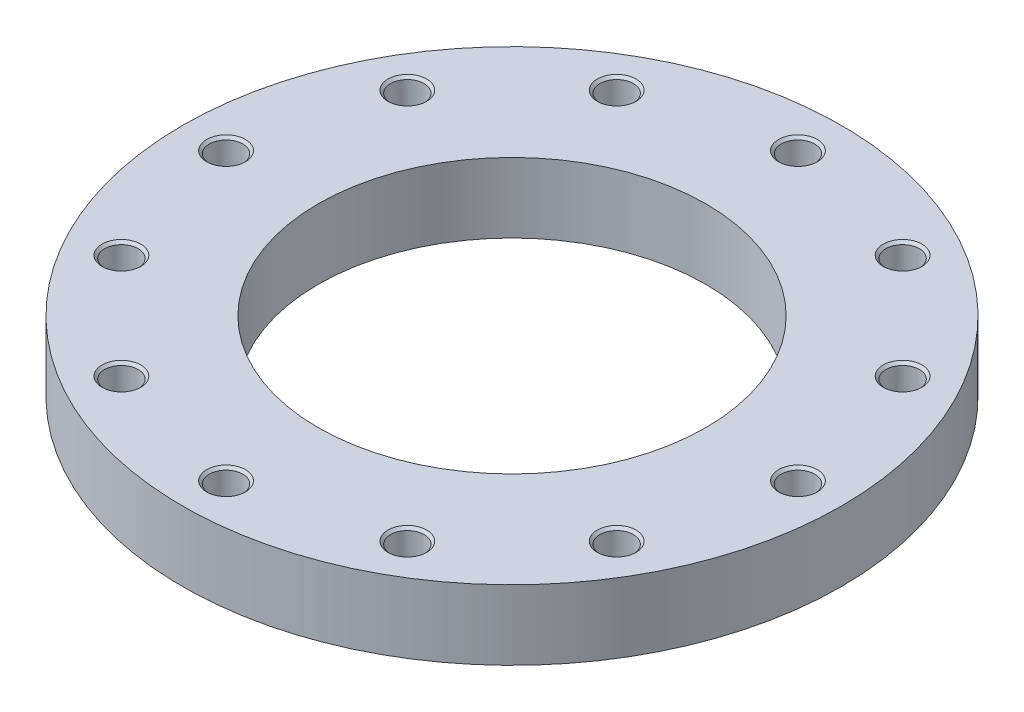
ISO-10303-21;
HEADER;
FILE_DESCRIPTION(('STEP AP214'),'2;1');
FILE_NAME('part.step','',(''),(''),'','','');
FILE_SCHEMA(('AUTOMOTIVE_DESIGN { 1 0 10303 214 1 1 1 1 }'));
ENDSEC;
DATA;
#1=APPLICATION_CONTEXT('core data for automotive mechanical design processes');
#2=APPLICATION_PROTOCOL_DEFINITION('international standard','automotive_design',2000,#1);
#3=PRODUCT_CONTEXT('',#1,'mechanical');
#4=PRODUCT('Part','Part','',(#3));
#5=PRODUCT_RELATED_PRODUCT_CATEGORY('part','',(#4));
#6=PRODUCT_DEFINITION_FORMATION('','',#4);
#7=PRODUCT_DEFINITION_CONTEXT('part definition',#1,'design');
#8=PRODUCT_DEFINITION('design','',#6,#7);
#9=PRODUCT_DEFINITION_SHAPE('','',#8);
#10=(LENGTH_UNIT() NAMED_UNIT(*) SI_UNIT(.MILLI.,.METRE.));
#11=(NAMED_UNIT(*) PLANE_ANGLE_UNIT() SI_UNIT($,.RADIAN.));
#12=(NAMED_UNIT(*) SI_UNIT($,.STERADIAN.) SOLID_ANGLE_UNIT());
#13=UNCERTAINTY_MEASURE_WITH_UNIT(LENGTH_MEASURE(1.E-05),#10,'distance_accuracy_value','');
#14=(GEOMETRIC_REPRESENTATION_CONTEXT(3) GLOBAL_UNCERTAINTY_ASSIGNED_CONTEXT((#13)) GLOBAL_UNIT_ASSIGNED_CONTEXT((#10,
#11,#12)) REPRESENTATION_CONTEXT('',''));
#15=CARTESIAN_POINT('',(0.,0.,0.));
#16=DIRECTION('',(0.,0.,1.));
#17=DIRECTION('',(1.,0.,0.));
#18=AXIS2_PLACEMENT_3D('',#15,#16,#17);
#19=CARTESIAN_POINT('',(0.,18.,0.));
#20=DIRECTION('',(0.,-1.,0.));
#21=DIRECTION('',(1.,0.,0.));
#22=AXIS2_PLACEMENT_3D('',#19,#20,#21);
#23=CYLINDRICAL_SURFACE('',#22,170.);
#24=CARTESIAN_POINT('',(0.,0.,0.));
#25=DIRECTION('',(0.,1.,0.));
#26=DIRECTION('',(1.,0.,0.));
#27=AXIS2_PLACEMENT_3D('',#24,#25,#26);
#28=CIRCLE('',#27,170.);
#29=CARTESIAN_POINT('',(170.,0.,0.));
#30=VERTEX_POINT('',#29);
#31=EDGE_CURVE('E9',#30,#30,#28,.T.);
#32=ORIENTED_EDGE('',*,*,#31,.T.);
#33=EDGE_LOOP('',(#32));
#34=FACE_BOUND('',#33,.T.);
#35=CARTESIAN_POINT('',(0.,36.,0.));
#36=DIRECTION('',(0.,1.,0.));
#37=DIRECTION('',(1.,0.,0.));
#38=AXIS2_PLACEMENT_3D('',#35,#36,#37);
#39=CIRCLE('',#38,170.);
#40=CARTESIAN_POINT('',(170.,36.,0.));
#41=VERTEX_POINT('',#40);
#42=EDGE_CURVE('E264',#41,#41,#39,.T.);
#43=ORIENTED_EDGE('',*,*,#42,.F.);
#44=EDGE_LOOP('',(#43));
#45=FACE_BOUND('',#44,.T.);
#46=ADVANCED_FACE('F15',(#34,#45),#23,.T.);
#47=CARTESIAN_POINT('',(135.,0.,0.));
#48=DIRECTION('',(0.,-1.,0.));
#49=DIRECTION('',(-1.,0.,0.));
#50=AXIS2_PLACEMENT_3D('',#47,#48,#49);
#51=PLANE('',#50);
#52=CARTESIAN_POINT('',(0.,0.,0.));
#53=DIRECTION('',(0.,1.,0.));
#54=DIRECTION('',(1.,0.,0.));
#55=AXIS2_PLACEMENT_3D('',#52,#53,#54);
#56=CIRCLE('',#55,100.);
#57=CARTESIAN_POINT('',(100.,0.,0.));
#58=VERTEX_POINT('',#57);
#59=EDGE_CURVE('E24',#58,#58,#56,.T.);
#60=ORIENTED_EDGE('',*,*,#59,.T.);
#61=EDGE_LOOP('',(#60));
#62=FACE_BOUND('',#61,.T.);
#63=ORIENTED_EDGE('',*,*,#31,.F.);
#64=EDGE_LOOP('',(#63));
#65=FACE_BOUND('',#64,.T.);
#66=ADVANCED_FACE('F17',(#62,#65),#51,.T.);
#67=CARTESIAN_POINT('',(0.,18.,0.));
#68=DIRECTION('',(0.,-1.,0.));
#69=DIRECTION('',(1.,0.,0.));
#70=AXIS2_PLACEMENT_3D('',#67,#68,#69);
#71=CYLINDRICAL_SURFACE('',#70,100.);
#72=CARTESIAN_POINT('',(0.,36.,0.));
#73=DIRECTION('',(0.,1.,0.));
#74=DIRECTION('',(1.,0.,0.));
#75=AXIS2_PLACEMENT_3D('',#72,#73,#74);
#76=CIRCLE('',#75,100.);
#77=CARTESIAN_POINT('',(100.,36.,0.));
#78=VERTEX_POINT('',#77);
#79=EDGE_CURVE('E257',#78,#78,#76,.T.);
#80=ORIENTED_EDGE('',*,*,#79,.T.);
#81=EDGE_LOOP('',(#80));
#82=FACE_BOUND('',#81,.T.);
#83=ORIENTED_EDGE('',*,*,#59,.F.);
#84=EDGE_LOOP('',(#83));
#85=FACE_BOUND('',#84,.T.);
#86=ADVANCED_FACE('F270',(#82,#85),#71,.F.);
#87=CARTESIAN_POINT('',(135.,36.,0.));
#88=DIRECTION('',(0.,1.,0.));
#89=DIRECTION('',(1.,0.,0.));
#90=AXIS2_PLACEMENT_3D('',#87,#88,#89);
#91=PLANE('',#90);
#92=ORIENTED_EDGE('',*,*,#42,.T.);
#93=EDGE_LOOP('',(#92));
#94=FACE_BOUND('',#93,.T.);
#95=ORIENTED_EDGE('',*,*,#79,.F.);
#96=EDGE_LOOP('',(#95));
#97=FACE_BOUND('',#96,.T.);
#98=CARTESIAN_POINT('',(147.5,36.,0.));
#99=DIRECTION('',(0.,-1.,0.));
#100=DIRECTION('',(1.,0.,0.));
#101=AXIS2_PLACEMENT_3D('',#98,#99,#100);
#102=CIRCLE('',#101,10.);
#103=CARTESIAN_POINT('',(157.5,36.,0.));
#104=VERTEX_POINT('',#103);
#105=EDGE_CURVE('E1140',#104,#104,#102,.T.);
#106=ORIENTED_EDGE('',*,*,#105,.T.);
#107=EDGE_LOOP('',(#106));
#108=FACE_BOUND('',#107,.T.);
#109=CARTESIAN_POINT('',(127.738747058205,36.,-73.75));
#110=DIRECTION('',(0.,-1.,0.));
#111=DIRECTION('',(0.866025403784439,0.,-0.5));
#112=AXIS2_PLACEMENT_3D('',#109,#110,#111);
#113=CIRCLE('',#112,10.);
#114=CARTESIAN_POINT('',(136.399001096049,36.,-78.75));
#115=VERTEX_POINT('',#114);
#116=EDGE_CURVE('E1182',#115,#115,#113,.T.);
#117=ORIENTED_EDGE('',*,*,#116,.T.);
#118=EDGE_LOOP('',(#117));
#119=FACE_BOUND('',#118,.T.);
#120=CARTESIAN_POINT('',(73.75,36.,-127.738747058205));
#121=DIRECTION('',(0.,-1.,0.));
#122=DIRECTION('',(0.5,0.,-0.866025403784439));
#123=AXIS2_PLACEMENT_3D('',#120,#121,#122);
#124=CIRCLE('',#123,10.);
#125=CARTESIAN_POINT('',(78.75,36.,-136.399001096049));
#126=VERTEX_POINT('',#125);
#127=EDGE_CURVE('E1170',#126,#126,#124,.T.);
#128=ORIENTED_EDGE('',*,*,#127,.T.);
#129=EDGE_LOOP('',(#128));
#130=FACE_BOUND('',#129,.T.);
#131=CARTESIAN_POINT('',(0.,36.,-147.5));
#132=DIRECTION('',(0.,-1.,0.));
#133=DIRECTION('',(0.,0.,-1.));
#134=AXIS2_PLACEMENT_3D('',#131,#132,#133);
#135=CIRCLE('',#134,10.);
#136=CARTESIAN_POINT('',(0.,36.,-157.5));
#137=VERTEX_POINT('',#136);
#138=EDGE_CURVE('E1156',#137,#137,#135,.T.);
#139=ORIENTED_EDGE('',*,*,#138,.T.);
#140=EDGE_LOOP('',(#139));
#141=FACE_BOUND('',#140,.T.);
#142=CARTESIAN_POINT('',(-73.75,36.,-127.738747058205));
#143=DIRECTION('',(0.,-1.,0.));
#144=DIRECTION('',(-0.5,0.,-0.866025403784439));
#145=AXIS2_PLACEMENT_3D('',#142,#143,#144);
#146=CIRCLE('',#145,10.);
#147=CARTESIAN_POINT('',(-78.75,36.,-136.399001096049));
#148=VERTEX_POINT('',#147);
#149=EDGE_CURVE('E1067',#148,#148,#146,.T.);
#150=ORIENTED_EDGE('',*,*,#149,.T.);
#151=EDGE_LOOP('',(#150));
#152=FACE_BOUND('',#151,.T.);
#153=CARTESIAN_POINT('',(-127.738747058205,36.,-73.75));
#154=DIRECTION('',(0.,-1.,0.));
#155=DIRECTION('',(-0.866025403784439,0.,-0.5));
#156=AXIS2_PLACEMENT_3D('',#153,#154,#155);
#157=CIRCLE('',#156,10.);
#158=CARTESIAN_POINT('',(-136.399001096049,36.,-78.75));
#159=VERTEX_POINT('',#158);
#160=EDGE_CURVE('E1138',#159,#159,#157,.T.);
#161=ORIENTED_EDGE('',*,*,#160,.T.);
#162=EDGE_LOOP('',(#161));
#163=FACE_BOUND('',#162,.T.);
#164=CARTESIAN_POINT('',(-147.5,36.,0.));
#165=DIRECTION('',(0.,-1.,0.));
#166=DIRECTION('',(-1.,0.,0.));
#167=AXIS2_PLACEMENT_3D('',#164,#165,#166);
#168=CIRCLE('',#167,10.);
#169=CARTESIAN_POINT('',(-157.5,36.,0.));
#170=VERTEX_POINT('',#169);
#171=EDGE_CURVE('E1130',#170,#170,#168,.T.);
#172=ORIENTED_EDGE('',*,*,#171,.T.);
#173=EDGE_LOOP('',(#172));
#174=FACE_BOUND('',#173,.T.);
#175=CARTESIAN_POINT('',(-127.738747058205,36.,73.75));
#176=DIRECTION('',(0.,-1.,0.));
#177=DIRECTION('',(-0.866025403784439,0.,0.5));
#178=AXIS2_PLACEMENT_3D('',#175,#176,#177);
#179=CIRCLE('',#178,10.);
#180=CARTESIAN_POINT('',(-136.399001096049,36.,78.75));
#181=VERTEX_POINT('',#180);
#182=EDGE_CURVE('E1122',#181,#181,#179,.T.);
#183=ORIENTED_EDGE('',*,*,#182,.T.);
#184=EDGE_LOOP('',(#183));
#185=FACE_BOUND('',#184,.T.);
#186=CARTESIAN_POINT('',(-73.75,36.,127.738747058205));
#187=DIRECTION('',(0.,-1.,0.));
#188=DIRECTION('',(-0.5,0.,0.866025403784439));
#189=AXIS2_PLACEMENT_3D('',#186,#187,#188);
#190=CIRCLE('',#189,10.);
#191=CARTESIAN_POINT('',(-78.75,36.,136.399001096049));
#192=VERTEX_POINT('',#191);
#193=EDGE_CURVE('E1110',#192,#192,#190,.T.);
#194=ORIENTED_EDGE('',*,*,#193,.T.);
#195=EDGE_LOOP('',(#194));
#196=FACE_BOUND('',#195,.T.);
#197=CARTESIAN_POINT('',(0.,36.,147.5));
#198=DIRECTION('',(0.,-1.,0.));
#199=DIRECTION('',(0.,0.,1.));
#200=AXIS2_PLACEMENT_3D('',#197,#198,#199);
#201=CIRCLE('',#200,10.);
#202=CARTESIAN_POINT('',(0.,36.,157.5));
#203=VERTEX_POINT('',#202);
#204=EDGE_CURVE('E1058',#203,#203,#201,.T.);
#205=ORIENTED_EDGE('',*,*,#204,.T.);
#206=EDGE_LOOP('',(#205));
#207=FACE_BOUND('',#206,.T.);
#208=CARTESIAN_POINT('',(73.75,36.,127.738747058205));
#209=DIRECTION('',(0.,-1.,0.));
#210=DIRECTION('',(0.5,0.,0.866025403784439));
#211=AXIS2_PLACEMENT_3D('',#208,#209,#210);
#212=CIRCLE('',#211,10.);
#213=CARTESIAN_POINT('',(78.75,36.,136.399001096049));
#214=VERTEX_POINT('',#213);
#215=EDGE_CURVE('E1073',#214,#214,#212,.T.);
#216=ORIENTED_EDGE('',*,*,#215,.T.);
#217=EDGE_LOOP('',(#216));
#218=FACE_BOUND('',#217,.T.);
#219=CARTESIAN_POINT('',(127.738747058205,36.,73.75));
#220=DIRECTION('',(0.,-1.,0.));
#221=DIRECTION('',(0.866025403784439,0.,0.5));
#222=AXIS2_PLACEMENT_3D('',#219,#220,#221);
#223=CIRCLE('',#222,10.);
#224=CARTESIAN_POINT('',(136.399001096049,36.,78.75));
#225=VERTEX_POINT('',#224);
#226=EDGE_CURVE('E1039',#225,#225,#223,.T.);
#227=ORIENTED_EDGE('',*,*,#226,.T.);
#228=EDGE_LOOP('',(#227));
#229=FACE_BOUND('',#228,.T.);
#230=ADVANCED_FACE('F272',(#94,#97,#108,#119,#130,#141,#152,#163,#174,#185,#196,#207,#218,#229),
#91,.T.);
#231=CARTESIAN_POINT('',(147.5,5.50386219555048,0.));
#232=DIRECTION('',(0.,1.,0.));
#233=DIRECTION('',(1.,0.,0.));
#234=AXIS2_PLACEMENT_3D('',#231,#232,#233);
#235=CONICAL_SURFACE('',#234,4.3234375,1.0471975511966);
#236=CARTESIAN_POINT('',(147.5,8.,0.));
#237=DIRECTION('',(0.,-1.,0.));
#238=DIRECTION('',(1.,0.,0.));
#239=AXIS2_PLACEMENT_3D('',#236,#237,#238);
#240=CIRCLE('',#239,8.646875);
#241=CARTESIAN_POINT('',(156.146875,8.,0.));
#242=VERTEX_POINT('',#241);
#243=EDGE_CURVE('E254',#242,#242,#240,.T.);
#244=ORIENTED_EDGE('',*,*,#243,.F.);
#245=EDGE_LOOP('',(#244));
#246=FACE_BOUND('',#245,.T.);
#247=CARTESIAN_POINT('',(147.5,3.00772439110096,0.));
#248=VERTEX_POINT('',#247);
#249=VERTEX_LOOP('',#248);
#250=FACE_BOUND('',#249,.T.);
#251=ADVANCED_FACE('F279',(#246,#250),#235,.F.);
#252=CARTESIAN_POINT('',(147.5,11.3234375,0.));
#253=DIRECTION('',(0.,1.,0.));
#254=DIRECTION('',(1.,0.,0.));
#255=AXIS2_PLACEMENT_3D('',#252,#253,#254);
#256=CYLINDRICAL_SURFACE('',#255,8.646875);
#257=CARTESIAN_POINT('',(147.5,14.646875,0.));
#258=DIRECTION('',(0.,-1.,0.));
#259=DIRECTION('',(1.,0.,0.));
#260=AXIS2_PLACEMENT_3D('',#257,#258,#259);
#261=CIRCLE('',#260,8.646875);
#262=CARTESIAN_POINT('',(156.146875,14.646875,0.));
#263=VERTEX_POINT('',#262);
#264=EDGE_CURVE('E251',#263,#263,#261,.T.);
#265=ORIENTED_EDGE('',*,*,#264,.F.);
#266=EDGE_LOOP('',(#265));
#267=FACE_BOUND('',#266,.T.);
#268=ORIENTED_EDGE('',*,*,#243,.T.);
#269=EDGE_LOOP('',(#268));
#270=FACE_BOUND('',#269,.T.);
#271=ADVANCED_FACE('F337',(#267,#270),#256,.F.);
#272=CARTESIAN_POINT('',(147.5,15.3234375,0.));
#273=DIRECTION('',(0.,1.,0.));
#274=DIRECTION('',(1.,0.,0.));
#275=AXIS2_PLACEMENT_3D('',#272,#273,#274);
#276=CONICAL_SURFACE('',#275,9.3234375,0.785398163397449);
#277=CARTESIAN_POINT('',(147.5,16.,0.));
#278=DIRECTION('',(0.,-1.,0.));
#279=DIRECTION('',(1.,0.,0.));
#280=AXIS2_PLACEMENT_3D('',#277,#278,#279);
#281=CIRCLE('',#280,10.);
#282=CARTESIAN_POINT('',(157.5,16.,0.));
#283=VERTEX_POINT('',#282);
#284=EDGE_CURVE('E255',#283,#283,#281,.T.);
#285=ORIENTED_EDGE('',*,*,#284,.F.);
#286=EDGE_LOOP('',(#285));
#287=FACE_BOUND('',#286,.T.);
#288=ORIENTED_EDGE('',*,*,#264,.T.);
#289=EDGE_LOOP('',(#288));
#290=FACE_BOUND('',#289,.T.);
#291=ADVANCED_FACE('F252',(#287,#290),#276,.F.);
#292=CARTESIAN_POINT('',(156.8234375,16.,0.));
#293=DIRECTION('',(0.,1.,0.));
#294=DIRECTION('',(-1.,0.,0.));
#295=AXIS2_PLACEMENT_3D('',#292,#293,#294);
#296=PLANE('',#295);
#297=CARTESIAN_POINT('',(147.5,16.,0.));
#298=DIRECTION('',(0.,-1.,0.));
#299=DIRECTION('',(1.,0.,0.));
#300=AXIS2_PLACEMENT_3D('',#297,#298,#299);
#301=CIRCLE('',#300,8.646875);
#302=CARTESIAN_POINT('',(156.146875,16.,0.));
#303=VERTEX_POINT('',#302);
#304=EDGE_CURVE('E259',#303,#303,#301,.T.);
#305=ORIENTED_EDGE('',*,*,#304,.F.);
#306=EDGE_LOOP('',(#305));
#307=FACE_BOUND('',#306,.T.);
#308=ORIENTED_EDGE('',*,*,#284,.T.);
#309=EDGE_LOOP('',(#308));
#310=FACE_BOUND('',#309,.T.);
#311=ADVANCED_FACE('F336',(#307,#310),#296,.F.);
#312=CARTESIAN_POINT('',(147.5,25.3234375,0.));
#313=DIRECTION('',(0.,1.,0.));
#314=DIRECTION('',(1.,0.,0.));
#315=AXIS2_PLACEMENT_3D('',#312,#313,#314);
#316=CYLINDRICAL_SURFACE('',#315,8.646875);
#317=CARTESIAN_POINT('',(147.5,34.646875,0.));
#318=DIRECTION('',(0.,-1.,0.));
#319=DIRECTION('',(1.,0.,0.));
#320=AXIS2_PLACEMENT_3D('',#317,#318,#319);
#321=CIRCLE('',#320,8.646875);
#322=CARTESIAN_POINT('',(156.146875,34.646875,0.));
#323=VERTEX_POINT('',#322);
#324=EDGE_CURVE('E1142',#323,#323,#321,.T.);
#325=ORIENTED_EDGE('',*,*,#324,.F.);
#326=EDGE_LOOP('',(#325));
#327=FACE_BOUND('',#326,.T.);
#328=ORIENTED_EDGE('',*,*,#304,.T.);
#329=EDGE_LOOP('',(#328));
#330=FACE_BOUND('',#329,.T.);
#331=ADVANCED_FACE('F359',(#327,#330),#316,.F.);
#332=CARTESIAN_POINT('',(147.5,35.3234375,0.));
#333=DIRECTION('',(0.,1.,0.));
#334=DIRECTION('',(1.,0.,0.));
#335=AXIS2_PLACEMENT_3D('',#332,#333,#334);
#336=CONICAL_SURFACE('',#335,9.3234375,0.785398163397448);
#337=ORIENTED_EDGE('',*,*,#105,.F.);
#338=EDGE_LOOP('',(#337));
#339=FACE_BOUND('',#338,.T.);
#340=ORIENTED_EDGE('',*,*,#324,.T.);
#341=EDGE_LOOP('',(#340));
#342=FACE_BOUND('',#341,.T.);
#343=ADVANCED_FACE('F534',(#339,#342),#336,.F.);
#344=CARTESIAN_POINT('',(127.738747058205,5.50386219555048,-73.75));
#345=DIRECTION('',(0.,1.,0.));
#346=DIRECTION('',(0.866025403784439,0.,-0.5));
#347=AXIS2_PLACEMENT_3D('',#344,#345,#346);
#348=CONICAL_SURFACE('',#347,4.3234375,1.0471975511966);
#349=CARTESIAN_POINT('',(127.738747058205,8.,-73.75));
#350=DIRECTION('',(0.,-1.,0.));
#351=DIRECTION('',(0.866025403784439,0.,-0.5));
#352=AXIS2_PLACEMENT_3D('',#349,#350,#351);
#353=CIRCLE('',#352,8.646875);
#354=CARTESIAN_POINT('',(135.227160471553,8.,-78.0734375));
#355=VERTEX_POINT('',#354);
#356=EDGE_CURVE('E1088',#355,#355,#353,.T.);
#357=ORIENTED_EDGE('',*,*,#356,.F.);
#358=EDGE_LOOP('',(#357));
#359=FACE_BOUND('',#358,.T.);
#360=CARTESIAN_POINT('',(127.738747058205,3.00772439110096,-73.75));
#361=VERTEX_POINT('',#360);
#362=VERTEX_LOOP('',#361);
#363=FACE_BOUND('',#362,.T.);
#364=ADVANCED_FACE('F324',(#359,#363),#348,.F.);
#365=CARTESIAN_POINT('',(127.738747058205,11.3234375,-73.75));
#366=DIRECTION('',(0.,1.,0.));
#367=DIRECTION('',(0.866025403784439,0.,-0.5));
#368=AXIS2_PLACEMENT_3D('',#365,#366,#367);
#369=CYLINDRICAL_SURFACE('',#368,8.646875);
#370=CARTESIAN_POINT('',(127.738747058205,14.646875,-73.75));
#371=DIRECTION('',(0.,-1.,0.));
#372=DIRECTION('',(0.866025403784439,0.,-0.5));
#373=AXIS2_PLACEMENT_3D('',#370,#371,#372);
#374=CIRCLE('',#373,8.646875);
#375=CARTESIAN_POINT('',(135.227160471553,14.646875,-78.0734375));
#376=VERTEX_POINT('',#375);
#377=EDGE_CURVE('E1086',#376,#376,#374,.T.);
#378=ORIENTED_EDGE('',*,*,#377,.F.);
#379=EDGE_LOOP('',(#378));
#380=FACE_BOUND('',#379,.T.);
#381=ORIENTED_EDGE('',*,*,#356,.T.);
#382=EDGE_LOOP('',(#381));
#383=FACE_BOUND('',#382,.T.);
#384=ADVANCED_FACE('F320',(#380,#383),#369,.F.);
#385=CARTESIAN_POINT('',(127.738747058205,15.3234375,-73.75));
#386=DIRECTION('',(0.,1.,0.));
#387=DIRECTION('',(0.866025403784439,0.,-0.5));
#388=AXIS2_PLACEMENT_3D('',#385,#386,#387);
#389=CONICAL_SURFACE('',#388,9.3234375,0.785398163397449);
#390=CARTESIAN_POINT('',(127.738747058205,16.,-73.75));
#391=DIRECTION('',(0.,-1.,0.));
#392=DIRECTION('',(0.866025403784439,0.,-0.5));
#393=AXIS2_PLACEMENT_3D('',#390,#391,#392);
#394=CIRCLE('',#393,10.);
#395=CARTESIAN_POINT('',(136.399001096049,16.,-78.75));
#396=VERTEX_POINT('',#395);
#397=EDGE_CURVE('E1089',#396,#396,#394,.T.);
#398=ORIENTED_EDGE('',*,*,#397,.F.);
#399=EDGE_LOOP('',(#398));
#400=FACE_BOUND('',#399,.T.);
#401=ORIENTED_EDGE('',*,*,#377,.T.);
#402=EDGE_LOOP('',(#401));
#403=FACE_BOUND('',#402,.T.);
#404=ADVANCED_FACE('F323',(#400,#403),#389,.F.);
#405=CARTESIAN_POINT('',(135.813080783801,16.,-78.41171875));
#406=DIRECTION('',(0.,1.,0.));
#407=DIRECTION('',(-0.866025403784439,0.,0.5));
#408=AXIS2_PLACEMENT_3D('',#405,#406,#407);
#409=PLANE('',#408);
#410=CARTESIAN_POINT('',(127.738747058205,16.,-73.75));
#411=DIRECTION('',(0.,-1.,0.));
#412=DIRECTION('',(0.866025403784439,0.,-0.5));
#413=AXIS2_PLACEMENT_3D('',#410,#411,#412);
#414=CIRCLE('',#413,8.646875);
#415=CARTESIAN_POINT('',(135.227160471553,16.,-78.0734375));
#416=VERTEX_POINT('',#415);
#417=EDGE_CURVE('E1184',#416,#416,#414,.T.);
#418=ORIENTED_EDGE('',*,*,#417,.F.);
#419=EDGE_LOOP('',(#418));
#420=FACE_BOUND('',#419,.T.);
#421=ORIENTED_EDGE('',*,*,#397,.T.);
#422=EDGE_LOOP('',(#421));
#423=FACE_BOUND('',#422,.T.);
#424=ADVANCED_FACE('F524',(#420,#423),#409,.F.);
#425=CARTESIAN_POINT('',(127.738747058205,25.3234375,-73.75));
#426=DIRECTION('',(0.,1.,0.));
#427=DIRECTION('',(0.866025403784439,0.,-0.5));
#428=AXIS2_PLACEMENT_3D('',#425,#426,#427);
#429=CYLINDRICAL_SURFACE('',#428,8.646875);
#430=CARTESIAN_POINT('',(127.738747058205,34.646875,-73.75));
#431=DIRECTION('',(0.,-1.,0.));
#432=DIRECTION('',(0.866025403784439,0.,-0.5));
#433=AXIS2_PLACEMENT_3D('',#430,#431,#432);
#434=CIRCLE('',#433,8.646875);
#435=CARTESIAN_POINT('',(135.227160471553,34.646875,-78.0734375));
#436=VERTEX_POINT('',#435);
#437=EDGE_CURVE('E1180',#436,#436,#434,.T.);
#438=ORIENTED_EDGE('',*,*,#437,.F.);
#439=EDGE_LOOP('',(#438));
#440=FACE_BOUND('',#439,.T.);
#441=ORIENTED_EDGE('',*,*,#417,.T.);
#442=EDGE_LOOP('',(#441));
#443=FACE_BOUND('',#442,.T.);
#444=ADVANCED_FACE('F520',(#440,#443),#429,.F.);
#445=CARTESIAN_POINT('',(127.738747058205,35.3234375,-73.75));
#446=DIRECTION('',(0.,1.,0.));
#447=DIRECTION('',(0.866025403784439,0.,-0.5));
#448=AXIS2_PLACEMENT_3D('',#445,#446,#447);
#449=CONICAL_SURFACE('',#448,9.3234375,0.785398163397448);
#450=ORIENTED_EDGE('',*,*,#116,.F.);
#451=EDGE_LOOP('',(#450));
#452=FACE_BOUND('',#451,.T.);
#453=ORIENTED_EDGE('',*,*,#437,.T.);
#454=EDGE_LOOP('',(#453));
#455=FACE_BOUND('',#454,.T.);
#456=ADVANCED_FACE('F516',(#452,#455),#449,.F.);
#457=CARTESIAN_POINT('',(73.75,5.50386219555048,-127.738747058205));
#458=DIRECTION('',(0.,1.,0.));
#459=DIRECTION('',(0.5,0.,-0.866025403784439));
#460=AXIS2_PLACEMENT_3D('',#457,#458,#459);
#461=CONICAL_SURFACE('',#460,4.3234375,1.0471975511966);
#462=CARTESIAN_POINT('',(73.75,8.,-127.738747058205));
#463=DIRECTION('',(0.,-1.,0.));
#464=DIRECTION('',(0.5,0.,-0.866025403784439));
#465=AXIS2_PLACEMENT_3D('',#462,#463,#464);
#466=CIRCLE('',#465,8.646875);
#467=CARTESIAN_POINT('',(78.0734375,8.,-135.227160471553));
#468=VERTEX_POINT('',#467);
#469=EDGE_CURVE('E1178',#468,#468,#466,.T.);
#470=ORIENTED_EDGE('',*,*,#469,.F.);
#471=EDGE_LOOP('',(#470));
#472=FACE_BOUND('',#471,.T.);
#473=CARTESIAN_POINT('',(73.75,3.00772439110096,-127.738747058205));
#474=VERTEX_POINT('',#473);
#475=VERTEX_LOOP('',#474);
#476=FACE_BOUND('',#475,.T.);
#477=ADVANCED_FACE('F512',(#472,#476),#461,.F.);
#478=CARTESIAN_POINT('',(73.75,11.3234375,-127.738747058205));
#479=DIRECTION('',(0.,1.,0.));
#480=DIRECTION('',(0.5,0.,-0.866025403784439));
#481=AXIS2_PLACEMENT_3D('',#478,#479,#480);
#482=CYLINDRICAL_SURFACE('',#481,8.646875);
#483=CARTESIAN_POINT('',(73.75,14.646875,-127.738747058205));
#484=DIRECTION('',(0.,-1.,0.));
#485=DIRECTION('',(0.5,0.,-0.866025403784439));
#486=AXIS2_PLACEMENT_3D('',#483,#484,#485);
#487=CIRCLE('',#486,8.646875);
#488=CARTESIAN_POINT('',(78.0734375,14.646875,-135.227160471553));
#489=VERTEX_POINT('',#488);
#490=EDGE_CURVE('E1176',#489,#489,#487,.T.);
#491=ORIENTED_EDGE('',*,*,#490,.F.);
#492=EDGE_LOOP('',(#491));
#493=FACE_BOUND('',#492,.T.);
#494=ORIENTED_EDGE('',*,*,#469,.T.);
#495=EDGE_LOOP('',(#494));
#496=FACE_BOUND('',#495,.T.);
#497=ADVANCED_FACE('F508',(#493,#496),#482,.F.);
#498=CARTESIAN_POINT('',(73.75,15.3234375,-127.738747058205));
#499=DIRECTION('',(0.,1.,0.));
#500=DIRECTION('',(0.5,0.,-0.866025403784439));
#501=AXIS2_PLACEMENT_3D('',#498,#499,#500);
#502=CONICAL_SURFACE('',#501,9.3234375,0.785398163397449);
#503=CARTESIAN_POINT('',(73.75,16.,-127.738747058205));
#504=DIRECTION('',(0.,-1.,0.));
#505=DIRECTION('',(0.5,0.,-0.866025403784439));
#506=AXIS2_PLACEMENT_3D('',#503,#504,#505);
#507=CIRCLE('',#506,10.);
#508=CARTESIAN_POINT('',(78.75,16.,-136.399001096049));
#509=VERTEX_POINT('',#508);
#510=EDGE_CURVE('E1174',#509,#509,#507,.T.);
#511=ORIENTED_EDGE('',*,*,#510,.F.);
#512=EDGE_LOOP('',(#511));
#513=FACE_BOUND('',#512,.T.);
#514=ORIENTED_EDGE('',*,*,#490,.T.);
#515=EDGE_LOOP('',(#514));
#516=FACE_BOUND('',#515,.T.);
#517=ADVANCED_FACE('F504',(#513,#516),#502,.F.);
#518=CARTESIAN_POINT('',(78.41171875,16.,-135.813080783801));
#519=DIRECTION('',(0.,1.,0.));
#520=DIRECTION('',(-0.5,0.,0.866025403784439));
#521=AXIS2_PLACEMENT_3D('',#518,#519,#520);
#522=PLANE('',#521);
#523=CARTESIAN_POINT('',(73.75,16.,-127.738747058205));
#524=DIRECTION('',(0.,-1.,0.));
#525=DIRECTION('',(0.5,0.,-0.866025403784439));
#526=AXIS2_PLACEMENT_3D('',#523,#524,#525);
#527=CIRCLE('',#526,8.646875);
#528=CARTESIAN_POINT('',(78.0734375,16.,-135.227160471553));
#529=VERTEX_POINT('',#528);
#530=EDGE_CURVE('E1172',#529,#529,#527,.T.);
#531=ORIENTED_EDGE('',*,*,#530,.F.);
#532=EDGE_LOOP('',(#531));
#533=FACE_BOUND('',#532,.T.);
#534=ORIENTED_EDGE('',*,*,#510,.T.);
#535=EDGE_LOOP('',(#534));
#536=FACE_BOUND('',#535,.T.);
#537=ADVANCED_FACE('F499',(#533,#536),#522,.F.);
#538=CARTESIAN_POINT('',(73.75,25.3234375,-127.738747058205));
#539=DIRECTION('',(0.,1.,0.));
#540=DIRECTION('',(0.5,0.,-0.866025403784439));
#541=AXIS2_PLACEMENT_3D('',#538,#539,#540);
#542=CYLINDRICAL_SURFACE('',#541,8.646875);
#543=CARTESIAN_POINT('',(73.75,34.646875,-127.738747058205));
#544=DIRECTION('',(0.,-1.,0.));
#545=DIRECTION('',(0.5,0.,-0.866025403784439));
#546=AXIS2_PLACEMENT_3D('',#543,#544,#545);
#547=CIRCLE('',#546,8.646875);
#548=CARTESIAN_POINT('',(78.0734375,34.646875,-135.227160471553));
#549=VERTEX_POINT('',#548);
#550=EDGE_CURVE('E1167',#549,#549,#547,.T.);
#551=ORIENTED_EDGE('',*,*,#550,.F.);
#552=EDGE_LOOP('',(#551));
#553=FACE_BOUND('',#552,.T.);
#554=ORIENTED_EDGE('',*,*,#530,.T.);
#555=EDGE_LOOP('',(#554));
#556=FACE_BOUND('',#555,.T.);
#557=ADVANCED_FACE('F496',(#553,#556),#542,.F.);
#558=CARTESIAN_POINT('',(73.75,35.3234375,-127.738747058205));
#559=DIRECTION('',(0.,1.,0.));
#560=DIRECTION('',(0.5,0.,-0.866025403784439));
#561=AXIS2_PLACEMENT_3D('',#558,#559,#560);
#562=CONICAL_SURFACE('',#561,9.3234375,0.785398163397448);
#563=ORIENTED_EDGE('',*,*,#127,.F.);
#564=EDGE_LOOP('',(#563));
#565=FACE_BOUND('',#564,.T.);
#566=ORIENTED_EDGE('',*,*,#550,.T.);
#567=EDGE_LOOP('',(#566));
#568=FACE_BOUND('',#567,.T.);
#569=ADVANCED_FACE('F492',(#565,#568),#562,.F.);
#570=CARTESIAN_POINT('',(0.,5.50386219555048,-147.5));
#571=DIRECTION('',(0.,1.,0.));
#572=DIRECTION('',(0.,0.,-1.));
#573=AXIS2_PLACEMENT_3D('',#570,#571,#572);
#574=CONICAL_SURFACE('',#573,4.3234375,1.0471975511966);
#575=CARTESIAN_POINT('',(0.,8.,-147.5));
#576=DIRECTION('',(0.,-1.,0.));
#577=DIRECTION('',(0.,0.,-1.));
#578=AXIS2_PLACEMENT_3D('',#575,#576,#577);
#579=CIRCLE('',#578,8.646875);
#580=CARTESIAN_POINT('',(0.,8.,-156.146875));
#581=VERTEX_POINT('',#580);
#582=EDGE_CURVE('E1165',#581,#581,#579,.T.);
#583=ORIENTED_EDGE('',*,*,#582,.F.);
#584=EDGE_LOOP('',(#583));
#585=FACE_BOUND('',#584,.T.);
#586=CARTESIAN_POINT('',(0.,3.00772439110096,-147.5));
#587=VERTEX_POINT('',#586);
#588=VERTEX_LOOP('',#587);
#589=FACE_BOUND('',#588,.T.);
#590=ADVANCED_FACE('F488',(#585,#589),#574,.F.);
#591=CARTESIAN_POINT('',(0.,11.3234375,-147.5));
#592=DIRECTION('',(0.,1.,0.));
#593=DIRECTION('',(0.,0.,-1.));
#594=AXIS2_PLACEMENT_3D('',#591,#592,#593);
#595=CYLINDRICAL_SURFACE('',#594,8.646875);
#596=CARTESIAN_POINT('',(0.,14.646875,-147.5));
#597=DIRECTION('',(0.,-1.,0.));
#598=DIRECTION('',(0.,0.,-1.));
#599=AXIS2_PLACEMENT_3D('',#596,#597,#598);
#600=CIRCLE('',#599,8.646875);
#601=CARTESIAN_POINT('',(0.,14.646875,-156.146875));
#602=VERTEX_POINT('',#601);
#603=EDGE_CURVE('E1163',#602,#602,#600,.T.);
#604=ORIENTED_EDGE('',*,*,#603,.F.);
#605=EDGE_LOOP('',(#604));
#606=FACE_BOUND('',#605,.T.);
#607=ORIENTED_EDGE('',*,*,#582,.T.);
#608=EDGE_LOOP('',(#607));
#609=FACE_BOUND('',#608,.T.);
#610=ADVANCED_FACE('F484',(#606,#609),#595,.F.);
#611=CARTESIAN_POINT('',(0.,15.3234375,-147.5));
#612=DIRECTION('',(0.,1.,0.));
#613=DIRECTION('',(0.,0.,-1.));
#614=AXIS2_PLACEMENT_3D('',#611,#612,#613);
#615=CONICAL_SURFACE('',#614,9.3234375,0.785398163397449);
#616=CARTESIAN_POINT('',(0.,16.,-147.5));
#617=DIRECTION('',(0.,-1.,0.));
#618=DIRECTION('',(0.,0.,-1.));
#619=AXIS2_PLACEMENT_3D('',#616,#617,#618);
#620=CIRCLE('',#619,10.);
#621=CARTESIAN_POINT('',(0.,16.,-157.5));
#622=VERTEX_POINT('',#621);
#623=EDGE_CURVE('E1160',#622,#622,#620,.T.);
#624=ORIENTED_EDGE('',*,*,#623,.F.);
#625=EDGE_LOOP('',(#624));
#626=FACE_BOUND('',#625,.T.);
#627=ORIENTED_EDGE('',*,*,#603,.T.);
#628=EDGE_LOOP('',(#627));
#629=FACE_BOUND('',#628,.T.);
#630=ADVANCED_FACE('F480',(#626,#629),#615,.F.);
#631=CARTESIAN_POINT('',(0.,16.,-156.8234375));
#632=DIRECTION('',(0.,1.,0.));
#633=DIRECTION('',(0.,0.,1.));
#634=AXIS2_PLACEMENT_3D('',#631,#632,#633);
#635=PLANE('',#634);
#636=CARTESIAN_POINT('',(0.,16.,-147.5));
#637=DIRECTION('',(0.,-1.,0.));
#638=DIRECTION('',(0.,0.,-1.));
#639=AXIS2_PLACEMENT_3D('',#636,#637,#638);
#640=CIRCLE('',#639,8.646875);
#641=CARTESIAN_POINT('',(0.,16.,-156.146875));
#642=VERTEX_POINT('',#641);
#643=EDGE_CURVE('E1158',#642,#642,#640,.T.);
#644=ORIENTED_EDGE('',*,*,#643,.F.);
#645=EDGE_LOOP('',(#644));
#646=FACE_BOUND('',#645,.T.);
#647=ORIENTED_EDGE('',*,*,#623,.T.);
#648=EDGE_LOOP('',(#647));
#649=FACE_BOUND('',#648,.T.);
#650=ADVANCED_FACE('F476',(#646,#649),#635,.F.);
#651=CARTESIAN_POINT('',(0.,25.3234375,-147.5));
#652=DIRECTION('',(0.,1.,0.));
#653=DIRECTION('',(0.,0.,-1.));
#654=AXIS2_PLACEMENT_3D('',#651,#652,#653);
#655=CYLINDRICAL_SURFACE('',#654,8.646875);
#656=CARTESIAN_POINT('',(0.,34.646875,-147.5));
#657=DIRECTION('',(0.,-1.,0.));
#658=DIRECTION('',(0.,0.,-1.));
#659=AXIS2_PLACEMENT_3D('',#656,#657,#658);
#660=CIRCLE('',#659,8.646875);
#661=CARTESIAN_POINT('',(0.,34.646875,-156.146875));
#662=VERTEX_POINT('',#661);
#663=EDGE_CURVE('E1154',#662,#662,#660,.T.);
#664=ORIENTED_EDGE('',*,*,#663,.F.);
#665=EDGE_LOOP('',(#664));
#666=FACE_BOUND('',#665,.T.);
#667=ORIENTED_EDGE('',*,*,#643,.T.);
#668=EDGE_LOOP('',(#667));
#669=FACE_BOUND('',#668,.T.);
#670=ADVANCED_FACE('F297',(#666,#669),#655,.F.);
#671=CARTESIAN_POINT('',(0.,35.3234375,-147.5));
#672=DIRECTION('',(0.,1.,0.));
#673=DIRECTION('',(0.,0.,-1.));
#674=AXIS2_PLACEMENT_3D('',#671,#672,#673);
#675=CONICAL_SURFACE('',#674,9.3234375,0.785398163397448);
#676=ORIENTED_EDGE('',*,*,#138,.F.);
#677=EDGE_LOOP('',(#676));
#678=FACE_BOUND('',#677,.T.);
#679=ORIENTED_EDGE('',*,*,#663,.T.);
#680=EDGE_LOOP('',(#679));
#681=FACE_BOUND('',#680,.T.);
#682=ADVANCED_FACE('F293',(#678,#681),#675,.F.);
#683=CARTESIAN_POINT('',(-73.75,5.50386219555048,-127.738747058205));
#684=DIRECTION('',(0.,1.,0.));
#685=DIRECTION('',(-0.5,0.,-0.866025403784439));
#686=AXIS2_PLACEMENT_3D('',#683,#684,#685);
#687=CONICAL_SURFACE('',#686,4.3234375,1.0471975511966);
#688=CARTESIAN_POINT('',(-73.75,8.,-127.738747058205));
#689=DIRECTION('',(0.,-1.,0.));
#690=DIRECTION('',(-0.5,0.,-0.866025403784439));
#691=AXIS2_PLACEMENT_3D('',#688,#689,#690);
#692=CIRCLE('',#691,8.646875);
#693=CARTESIAN_POINT('',(-78.0734375,8.,-135.227160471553));
#694=VERTEX_POINT('',#693);
#695=EDGE_CURVE('E1152',#694,#694,#692,.T.);
#696=ORIENTED_EDGE('',*,*,#695,.F.);
#697=EDGE_LOOP('',(#696));
#698=FACE_BOUND('',#697,.T.);
#699=CARTESIAN_POINT('',(-73.75,3.00772439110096,-127.738747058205));
#700=VERTEX_POINT('',#699);
#701=VERTEX_LOOP('',#700);
#702=FACE_BOUND('',#701,.T.);
#703=ADVANCED_FACE('F296',(#698,#702),#687,.F.);
#704=CARTESIAN_POINT('',(-73.75,11.3234375,-127.738747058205));
#705=DIRECTION('',(0.,1.,0.));
#706=DIRECTION('',(-0.5,0.,-0.866025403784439));
#707=AXIS2_PLACEMENT_3D('',#704,#705,#706);
#708=CYLINDRICAL_SURFACE('',#707,8.646875);
#709=CARTESIAN_POINT('',(-73.75,14.646875,-127.738747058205));
#710=DIRECTION('',(0.,-1.,0.));
#711=DIRECTION('',(-0.5,0.,-0.866025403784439));
#712=AXIS2_PLACEMENT_3D('',#709,#710,#711);
#713=CIRCLE('',#712,8.646875);
#714=CARTESIAN_POINT('',(-78.0734375,14.646875,-135.227160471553));
#715=VERTEX_POINT('',#714);
#716=EDGE_CURVE('E1150',#715,#715,#713,.T.);
#717=ORIENTED_EDGE('',*,*,#716,.F.);
#718=EDGE_LOOP('',(#717));
#719=FACE_BOUND('',#718,.T.);
#720=ORIENTED_EDGE('',*,*,#695,.T.);
#721=EDGE_LOOP('',(#720));
#722=FACE_BOUND('',#721,.T.);
#723=ADVANCED_FACE('F466',(#719,#722),#708,.F.);
#724=CARTESIAN_POINT('',(-73.75,15.3234375,-127.738747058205));
#725=DIRECTION('',(0.,1.,0.));
#726=DIRECTION('',(-0.5,0.,-0.866025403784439));
#727=AXIS2_PLACEMENT_3D('',#724,#725,#726);
#728=CONICAL_SURFACE('',#727,9.3234375,0.785398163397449);
#729=CARTESIAN_POINT('',(-73.75,16.,-127.738747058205));
#730=DIRECTION('',(0.,-1.,0.));
#731=DIRECTION('',(-0.5,0.,-0.866025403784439));
#732=AXIS2_PLACEMENT_3D('',#729,#730,#731);
#733=CIRCLE('',#732,10.);
#734=CARTESIAN_POINT('',(-78.75,16.,-136.399001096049));
#735=VERTEX_POINT('',#734);
#736=EDGE_CURVE('E1148',#735,#735,#733,.T.);
#737=ORIENTED_EDGE('',*,*,#736,.F.);
#738=EDGE_LOOP('',(#737));
#739=FACE_BOUND('',#738,.T.);
#740=ORIENTED_EDGE('',*,*,#716,.T.);
#741=EDGE_LOOP('',(#740));
#742=FACE_BOUND('',#741,.T.);
#743=ADVANCED_FACE('F462',(#739,#742),#728,.F.);
#744=CARTESIAN_POINT('',(-78.41171875,16.,-135.813080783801));
#745=DIRECTION('',(0.,1.,0.));
#746=DIRECTION('',(0.5,0.,0.866025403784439));
#747=AXIS2_PLACEMENT_3D('',#744,#745,#746);
#748=PLANE('',#747);
#749=CARTESIAN_POINT('',(-73.75,16.,-127.738747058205));
#750=DIRECTION('',(0.,-1.,0.));
#751=DIRECTION('',(-0.5,0.,-0.866025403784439));
#752=AXIS2_PLACEMENT_3D('',#749,#750,#751);
#753=CIRCLE('',#752,8.646875);
#754=CARTESIAN_POINT('',(-78.0734375,16.,-135.227160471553));
#755=VERTEX_POINT('',#754);
#756=EDGE_CURVE('E1069',#755,#755,#753,.T.);
#757=ORIENTED_EDGE('',*,*,#756,.F.);
#758=EDGE_LOOP('',(#757));
#759=FACE_BOUND('',#758,.T.);
#760=ORIENTED_EDGE('',*,*,#736,.T.);
#761=EDGE_LOOP('',(#760));
#762=FACE_BOUND('',#761,.T.);
#763=ADVANCED_FACE('F458',(#759,#762),#748,.F.);
#764=CARTESIAN_POINT('',(-73.75,25.3234375,-127.738747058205));
#765=DIRECTION('',(0.,1.,0.));
#766=DIRECTION('',(-0.5,0.,-0.866025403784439));
#767=AXIS2_PLACEMENT_3D('',#764,#765,#766);
#768=CYLINDRICAL_SURFACE('',#767,8.646875);
#769=CARTESIAN_POINT('',(-73.75,34.646875,-127.738747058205));
#770=DIRECTION('',(0.,-1.,0.));
#771=DIRECTION('',(-0.5,0.,-0.866025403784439));
#772=AXIS2_PLACEMENT_3D('',#769,#770,#771);
#773=CIRCLE('',#772,8.646875);
#774=CARTESIAN_POINT('',(-78.0734375,34.646875,-135.227160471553));
#775=VERTEX_POINT('',#774);
#776=EDGE_CURVE('E1057',#775,#775,#773,.T.);
#777=ORIENTED_EDGE('',*,*,#776,.F.);
#778=EDGE_LOOP('',(#777));
#779=FACE_BOUND('',#778,.T.);
#780=ORIENTED_EDGE('',*,*,#756,.T.);
#781=EDGE_LOOP('',(#780));
#782=FACE_BOUND('',#781,.T.);
#783=ADVANCED_FACE('F454',(#779,#782),#768,.F.);
#784=CARTESIAN_POINT('',(-73.75,35.3234375,-127.738747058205));
#785=DIRECTION('',(0.,1.,0.));
#786=DIRECTION('',(-0.5,0.,-0.866025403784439));
#787=AXIS2_PLACEMENT_3D('',#784,#785,#786);
#788=CONICAL_SURFACE('',#787,9.3234375,0.785398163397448);
#789=ORIENTED_EDGE('',*,*,#149,.F.);
#790=EDGE_LOOP('',(#789));
#791=FACE_BOUND('',#790,.T.);
#792=ORIENTED_EDGE('',*,*,#776,.T.);
#793=EDGE_LOOP('',(#792));
#794=FACE_BOUND('',#793,.T.);
#795=ADVANCED_FACE('F450',(#791,#794),#788,.F.);
#796=CARTESIAN_POINT('',(-127.738747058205,5.50386219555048,-73.75));
#797=DIRECTION('',(0.,1.,0.));
#798=DIRECTION('',(-0.866025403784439,0.,-0.5));
#799=AXIS2_PLACEMENT_3D('',#796,#797,#798);
#800=CONICAL_SURFACE('',#799,4.3234375,1.0471975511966);
#801=CARTESIAN_POINT('',(-127.738747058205,8.,-73.75));
#802=DIRECTION('',(0.,-1.,0.));
#803=DIRECTION('',(-0.866025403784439,0.,-0.5));
#804=AXIS2_PLACEMENT_3D('',#801,#802,#803);
#805=CIRCLE('',#804,8.646875);
#806=CARTESIAN_POINT('',(-135.227160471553,8.,-78.0734375));
#807=VERTEX_POINT('',#806);
#808=EDGE_CURVE('E1055',#807,#807,#805,.T.);
#809=ORIENTED_EDGE('',*,*,#808,.F.);
#810=EDGE_LOOP('',(#809));
#811=FACE_BOUND('',#810,.T.);
#812=CARTESIAN_POINT('',(-127.738747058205,3.00772439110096,-73.75));
#813=VERTEX_POINT('',#812);
#814=VERTEX_LOOP('',#813);
#815=FACE_BOUND('',#814,.T.);
#816=ADVANCED_FACE('F446',(#811,#815),#800,.F.);
#817=CARTESIAN_POINT('',(-127.738747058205,11.3234375,-73.75));
#818=DIRECTION('',(0.,1.,0.));
#819=DIRECTION('',(-0.866025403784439,0.,-0.5));
#820=AXIS2_PLACEMENT_3D('',#817,#818,#819);
#821=CYLINDRICAL_SURFACE('',#820,8.646875);
#822=CARTESIAN_POINT('',(-127.738747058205,14.646875,-73.75));
#823=DIRECTION('',(0.,-1.,0.));
#824=DIRECTION('',(-0.866025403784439,0.,-0.5));
#825=AXIS2_PLACEMENT_3D('',#822,#823,#824);
#826=CIRCLE('',#825,8.646875);
#827=CARTESIAN_POINT('',(-135.227160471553,14.646875,-78.0734375));
#828=VERTEX_POINT('',#827);
#829=EDGE_CURVE('E1052',#828,#828,#826,.T.);
#830=ORIENTED_EDGE('',*,*,#829,.F.);
#831=EDGE_LOOP('',(#830));
#832=FACE_BOUND('',#831,.T.);
#833=ORIENTED_EDGE('',*,*,#808,.T.);
#834=EDGE_LOOP('',(#833));
#835=FACE_BOUND('',#834,.T.);
#836=ADVANCED_FACE('F442',(#832,#835),#821,.F.);
#837=CARTESIAN_POINT('',(-127.738747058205,15.3234375,-73.75));
#838=DIRECTION('',(0.,1.,0.));
#839=DIRECTION('',(-0.866025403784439,0.,-0.5));
#840=AXIS2_PLACEMENT_3D('',#837,#838,#839);
#841=CONICAL_SURFACE('',#840,9.3234375,0.785398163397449);
#842=CARTESIAN_POINT('',(-127.738747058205,16.,-73.75));
#843=DIRECTION('',(0.,-1.,0.));
#844=DIRECTION('',(-0.866025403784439,0.,-0.5));
#845=AXIS2_PLACEMENT_3D('',#842,#843,#844);
#846=CIRCLE('',#845,10.);
#847=CARTESIAN_POINT('',(-136.399001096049,16.,-78.75));
#848=VERTEX_POINT('',#847);
#849=EDGE_CURVE('E1051',#848,#848,#846,.T.);
#850=ORIENTED_EDGE('',*,*,#849,.F.);
#851=EDGE_LOOP('',(#850));
#852=FACE_BOUND('',#851,.T.);
#853=ORIENTED_EDGE('',*,*,#829,.T.);
#854=EDGE_LOOP('',(#853));
#855=FACE_BOUND('',#854,.T.);
#856=ADVANCED_FACE('F377',(#852,#855),#841,.F.);
#857=CARTESIAN_POINT('',(-135.813080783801,16.,-78.41171875));
#858=DIRECTION('',(0.,1.,0.));
#859=DIRECTION('',(0.866025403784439,0.,0.5));
#860=AXIS2_PLACEMENT_3D('',#857,#858,#859);
#861=PLANE('',#860);
#862=CARTESIAN_POINT('',(-127.738747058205,16.,-73.75));
#863=DIRECTION('',(0.,-1.,0.));
#864=DIRECTION('',(-0.866025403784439,0.,-0.5));
#865=AXIS2_PLACEMENT_3D('',#862,#863,#864);
#866=CIRCLE('',#865,8.646875);
#867=CARTESIAN_POINT('',(-135.227160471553,16.,-78.0734375));
#868=VERTEX_POINT('',#867);
#869=EDGE_CURVE('E1053',#868,#868,#866,.T.);
#870=ORIENTED_EDGE('',*,*,#869,.F.);
#871=EDGE_LOOP('',(#870));
#872=FACE_BOUND('',#871,.T.);
#873=ORIENTED_EDGE('',*,*,#849,.T.);
#874=EDGE_LOOP('',(#873));
#875=FACE_BOUND('',#874,.T.);
#876=ADVANCED_FACE('F373',(#872,#875),#861,.F.);
#877=CARTESIAN_POINT('',(-127.738747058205,25.3234375,-73.75));
#878=DIRECTION('',(0.,1.,0.));
#879=DIRECTION('',(-0.866025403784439,0.,-0.5));
#880=AXIS2_PLACEMENT_3D('',#877,#878,#879);
#881=CYLINDRICAL_SURFACE('',#880,8.646875);
#882=CARTESIAN_POINT('',(-127.738747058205,34.646875,-73.75));
#883=DIRECTION('',(0.,-1.,0.));
#884=DIRECTION('',(-0.866025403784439,0.,-0.5));
#885=AXIS2_PLACEMENT_3D('',#882,#883,#884);
#886=CIRCLE('',#885,8.646875);
#887=CARTESIAN_POINT('',(-135.227160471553,34.646875,-78.0734375));
#888=VERTEX_POINT('',#887);
#889=EDGE_CURVE('E1136',#888,#888,#886,.T.);
#890=ORIENTED_EDGE('',*,*,#889,.F.);
#891=EDGE_LOOP('',(#890));
#892=FACE_BOUND('',#891,.T.);
#893=ORIENTED_EDGE('',*,*,#869,.T.);
#894=EDGE_LOOP('',(#893));
#895=FACE_BOUND('',#894,.T.);
#896=ADVANCED_FACE('F376',(#892,#895),#881,.F.);
#897=CARTESIAN_POINT('',(-127.738747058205,35.3234375,-73.75));
#898=DIRECTION('',(0.,1.,0.));
#899=DIRECTION('',(-0.866025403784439,0.,-0.5));
#900=AXIS2_PLACEMENT_3D('',#897,#898,#899);
#901=CONICAL_SURFACE('',#900,9.3234375,0.785398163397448);
#902=ORIENTED_EDGE('',*,*,#160,.F.);
#903=EDGE_LOOP('',(#902));
#904=FACE_BOUND('',#903,.T.);
#905=ORIENTED_EDGE('',*,*,#889,.T.);
#906=EDGE_LOOP('',(#905));
#907=FACE_BOUND('',#906,.T.);
#908=ADVANCED_FACE('F432',(#904,#907),#901,.F.);
#909=CARTESIAN_POINT('',(-147.5,5.50386219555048,0.));
#910=DIRECTION('',(0.,1.,0.));
#911=DIRECTION('',(-1.,0.,0.));
#912=AXIS2_PLACEMENT_3D('',#909,#910,#911);
#913=CONICAL_SURFACE('',#912,4.3234375,1.0471975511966);
#914=CARTESIAN_POINT('',(-147.5,8.,0.));
#915=DIRECTION('',(0.,-1.,0.));
#916=DIRECTION('',(-1.,0.,0.));
#917=AXIS2_PLACEMENT_3D('',#914,#915,#916);
#918=CIRCLE('',#917,8.646875);
#919=CARTESIAN_POINT('',(-156.146875,8.,0.));
#920=VERTEX_POINT('',#919);
#921=EDGE_CURVE('E1134',#920,#920,#918,.T.);
#922=ORIENTED_EDGE('',*,*,#921,.F.);
#923=EDGE_LOOP('',(#922));
#924=FACE_BOUND('',#923,.T.);
#925=CARTESIAN_POINT('',(-147.5,3.00772439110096,0.));
#926=VERTEX_POINT('',#925);
#927=VERTEX_LOOP('',#926);
#928=FACE_BOUND('',#927,.T.);
#929=ADVANCED_FACE('F343',(#924,#928),#913,.F.);
#930=CARTESIAN_POINT('',(-147.5,11.3234375,0.));
#931=DIRECTION('',(0.,1.,0.));
#932=DIRECTION('',(-1.,0.,0.));
#933=AXIS2_PLACEMENT_3D('',#930,#931,#932);
#934=CYLINDRICAL_SURFACE('',#933,8.646875);
#935=CARTESIAN_POINT('',(-147.5,14.646875,0.));
#936=DIRECTION('',(0.,-1.,0.));
#937=DIRECTION('',(-1.,0.,0.));
#938=AXIS2_PLACEMENT_3D('',#935,#936,#937);
#939=CIRCLE('',#938,8.646875);
#940=CARTESIAN_POINT('',(-156.146875,14.646875,0.));
#941=VERTEX_POINT('',#940);
#942=EDGE_CURVE('E1101',#941,#941,#939,.T.);
#943=ORIENTED_EDGE('',*,*,#942,.F.);
#944=EDGE_LOOP('',(#943));
#945=FACE_BOUND('',#944,.T.);
#946=ORIENTED_EDGE('',*,*,#921,.T.);
#947=EDGE_LOOP('',(#946));
#948=FACE_BOUND('',#947,.T.);
#949=ADVANCED_FACE('F339',(#945,#948),#934,.F.);
#950=CARTESIAN_POINT('',(-147.5,15.3234375,0.));
#951=DIRECTION('',(0.,1.,0.));
#952=DIRECTION('',(-1.,0.,0.));
#953=AXIS2_PLACEMENT_3D('',#950,#951,#952);
#954=CONICAL_SURFACE('',#953,9.3234375,0.785398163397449);
#955=CARTESIAN_POINT('',(-147.5,16.,0.));
#956=DIRECTION('',(0.,-1.,0.));
#957=DIRECTION('',(-1.,0.,0.));
#958=AXIS2_PLACEMENT_3D('',#955,#956,#957);
#959=CIRCLE('',#958,10.);
#960=CARTESIAN_POINT('',(-157.5,16.,0.));
#961=VERTEX_POINT('',#960);
#962=EDGE_CURVE('E1099',#961,#961,#959,.T.);
#963=ORIENTED_EDGE('',*,*,#962,.F.);
#964=EDGE_LOOP('',(#963));
#965=FACE_BOUND('',#964,.T.);
#966=ORIENTED_EDGE('',*,*,#942,.T.);
#967=EDGE_LOOP('',(#966));
#968=FACE_BOUND('',#967,.T.);
#969=ADVANCED_FACE('F342',(#965,#968),#954,.F.);
#970=CARTESIAN_POINT('',(-156.8234375,16.,0.));
#971=DIRECTION('',(0.,1.,0.));
#972=DIRECTION('',(1.,0.,0.));
#973=AXIS2_PLACEMENT_3D('',#970,#971,#972);
#974=PLANE('',#973);
#975=CARTESIAN_POINT('',(-147.5,16.,0.));
#976=DIRECTION('',(0.,-1.,0.));
#977=DIRECTION('',(-1.,0.,0.));
#978=AXIS2_PLACEMENT_3D('',#975,#976,#977);
#979=CIRCLE('',#978,8.646875);
#980=CARTESIAN_POINT('',(-156.146875,16.,0.));
#981=VERTEX_POINT('',#980);
#982=EDGE_CURVE('E1102',#981,#981,#979,.T.);
#983=ORIENTED_EDGE('',*,*,#982,.F.);
#984=EDGE_LOOP('',(#983));
#985=FACE_BOUND('',#984,.T.);
#986=ORIENTED_EDGE('',*,*,#962,.T.);
#987=EDGE_LOOP('',(#986));
#988=FACE_BOUND('',#987,.T.);
#989=ADVANCED_FACE('F422',(#985,#988),#974,.F.);
#990=CARTESIAN_POINT('',(-147.5,25.3234375,0.));
#991=DIRECTION('',(0.,1.,0.));
#992=DIRECTION('',(-1.,0.,0.));
#993=AXIS2_PLACEMENT_3D('',#990,#991,#992);
#994=CYLINDRICAL_SURFACE('',#993,8.646875);
#995=CARTESIAN_POINT('',(-147.5,34.646875,0.));
#996=DIRECTION('',(0.,-1.,0.));
#997=DIRECTION('',(-1.,0.,0.));
#998=AXIS2_PLACEMENT_3D('',#995,#996,#997);
#999=CIRCLE('',#998,8.646875);
#1000=CARTESIAN_POINT('',(-156.146875,34.646875,0.));
#1001=VERTEX_POINT('',#1000);
#1002=EDGE_CURVE('E1092',#1001,#1001,#999,.T.);
#1003=ORIENTED_EDGE('',*,*,#1002,.F.);
#1004=EDGE_LOOP('',(#1003));
#1005=FACE_BOUND('',#1004,.T.);
#1006=ORIENTED_EDGE('',*,*,#982,.T.);
#1007=EDGE_LOOP('',(#1006));
#1008=FACE_BOUND('',#1007,.T.);
#1009=ADVANCED_FACE('F418',(#1005,#1008),#994,.F.);
#1010=CARTESIAN_POINT('',(-147.5,35.3234375,0.));
#1011=DIRECTION('',(0.,1.,0.));
#1012=DIRECTION('',(-1.,0.,0.));
#1013=AXIS2_PLACEMENT_3D('',#1010,#1011,#1012);
#1014=CONICAL_SURFACE('',#1013,9.3234375,0.785398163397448);
#1015=ORIENTED_EDGE('',*,*,#171,.F.);
#1016=EDGE_LOOP('',(#1015));
#1017=FACE_BOUND('',#1016,.T.);
#1018=ORIENTED_EDGE('',*,*,#1002,.T.);
#1019=EDGE_LOOP('',(#1018));
#1020=FACE_BOUND('',#1019,.T.);
#1021=ADVANCED_FACE('F414',(#1017,#1020),#1014,.F.);
#1022=CARTESIAN_POINT('',(-127.738747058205,5.50386219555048,73.75));
#1023=DIRECTION('',(0.,1.,0.));
#1024=DIRECTION('',(-0.866025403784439,0.,0.5));
#1025=AXIS2_PLACEMENT_3D('',#1022,#1023,#1024);
#1026=CONICAL_SURFACE('',#1025,4.3234375,1.0471975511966);
#1027=CARTESIAN_POINT('',(-127.738747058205,8.,73.75));
#1028=DIRECTION('',(0.,-1.,0.));
#1029=DIRECTION('',(-0.866025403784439,0.,0.5));
#1030=AXIS2_PLACEMENT_3D('',#1027,#1028,#1029);
#1031=CIRCLE('',#1030,8.646875);
#1032=CARTESIAN_POINT('',(-135.227160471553,8.,78.0734374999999));
#1033=VERTEX_POINT('',#1032);
#1034=EDGE_CURVE('E1090',#1033,#1033,#1031,.T.);
#1035=ORIENTED_EDGE('',*,*,#1034,.F.);
#1036=EDGE_LOOP('',(#1035));
#1037=FACE_BOUND('',#1036,.T.);
#1038=CARTESIAN_POINT('',(-127.738747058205,3.00772439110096,73.75));
#1039=VERTEX_POINT('',#1038);
#1040=VERTEX_LOOP('',#1039);
#1041=FACE_BOUND('',#1040,.T.);
#1042=ADVANCED_FACE('F411',(#1037,#1041),#1026,.F.);
#1043=CARTESIAN_POINT('',(-127.738747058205,11.3234375,73.75));
#1044=DIRECTION('',(0.,1.,0.));
#1045=DIRECTION('',(-0.866025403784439,0.,0.5));
#1046=AXIS2_PLACEMENT_3D('',#1043,#1044,#1045);
#1047=CYLINDRICAL_SURFACE('',#1046,8.646875);
#1048=CARTESIAN_POINT('',(-127.738747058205,14.646875,73.75));
#1049=DIRECTION('',(0.,-1.,0.));
#1050=DIRECTION('',(-0.866025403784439,0.,0.5));
#1051=AXIS2_PLACEMENT_3D('',#1048,#1049,#1050);
#1052=CIRCLE('',#1051,8.646875);
#1053=CARTESIAN_POINT('',(-135.227160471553,14.646875,78.0734374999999));
#1054=VERTEX_POINT('',#1053);
#1055=EDGE_CURVE('E1093',#1054,#1054,#1052,.T.);
#1056=ORIENTED_EDGE('',*,*,#1055,.F.);
#1057=EDGE_LOOP('',(#1056));
#1058=FACE_BOUND('',#1057,.T.);
#1059=ORIENTED_EDGE('',*,*,#1034,.T.);
#1060=EDGE_LOOP('',(#1059));
#1061=FACE_BOUND('',#1060,.T.);
#1062=ADVANCED_FACE('F409',(#1058,#1061),#1047,.F.);
#1063=CARTESIAN_POINT('',(-127.738747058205,15.3234375,73.75));
#1064=DIRECTION('',(0.,1.,0.));
#1065=DIRECTION('',(-0.866025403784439,0.,0.5));
#1066=AXIS2_PLACEMENT_3D('',#1063,#1064,#1065);
#1067=CONICAL_SURFACE('',#1066,9.3234375,0.785398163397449);
#1068=CARTESIAN_POINT('',(-127.738747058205,16.,73.75));
#1069=DIRECTION('',(0.,-1.,0.));
#1070=DIRECTION('',(-0.866025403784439,0.,0.5));
#1071=AXIS2_PLACEMENT_3D('',#1068,#1069,#1070);
#1072=CIRCLE('',#1071,10.);
#1073=CARTESIAN_POINT('',(-136.399001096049,16.,78.75));
#1074=VERTEX_POINT('',#1073);
#1075=EDGE_CURVE('E1126',#1074,#1074,#1072,.T.);
#1076=ORIENTED_EDGE('',*,*,#1075,.F.);
#1077=EDGE_LOOP('',(#1076));
#1078=FACE_BOUND('',#1077,.T.);
#1079=ORIENTED_EDGE('',*,*,#1055,.T.);
#1080=EDGE_LOOP('',(#1079));
#1081=FACE_BOUND('',#1080,.T.);
#1082=ADVANCED_FACE('F405',(#1078,#1081),#1067,.F.);
#1083=CARTESIAN_POINT('',(-135.813080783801,16.,78.41171875));
#1084=DIRECTION('',(0.,1.,0.));
#1085=DIRECTION('',(0.866025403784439,0.,-0.5));
#1086=AXIS2_PLACEMENT_3D('',#1083,#1084,#1085);
#1087=PLANE('',#1086);
#1088=CARTESIAN_POINT('',(-127.738747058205,16.,73.75));
#1089=DIRECTION('',(0.,-1.,0.));
#1090=DIRECTION('',(-0.866025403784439,0.,0.5));
#1091=AXIS2_PLACEMENT_3D('',#1088,#1089,#1090);
#1092=CIRCLE('',#1091,8.646875);
#1093=CARTESIAN_POINT('',(-135.227160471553,16.,78.0734374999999));
#1094=VERTEX_POINT('',#1093);
#1095=EDGE_CURVE('E1124',#1094,#1094,#1092,.T.);
#1096=ORIENTED_EDGE('',*,*,#1095,.F.);
#1097=EDGE_LOOP('',(#1096));
#1098=FACE_BOUND('',#1097,.T.);
#1099=ORIENTED_EDGE('',*,*,#1075,.T.);
#1100=EDGE_LOOP('',(#1099));
#1101=FACE_BOUND('',#1100,.T.);
#1102=ADVANCED_FACE('F401',(#1098,#1101),#1087,.F.);
#1103=CARTESIAN_POINT('',(-127.738747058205,25.3234375,73.75));
#1104=DIRECTION('',(0.,1.,0.));
#1105=DIRECTION('',(-0.866025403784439,0.,0.5));
#1106=AXIS2_PLACEMENT_3D('',#1103,#1104,#1105);
#1107=CYLINDRICAL_SURFACE('',#1106,8.646875);
#1108=CARTESIAN_POINT('',(-127.738747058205,34.646875,73.75));
#1109=DIRECTION('',(0.,-1.,0.));
#1110=DIRECTION('',(-0.866025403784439,0.,0.5));
#1111=AXIS2_PLACEMENT_3D('',#1108,#1109,#1110);
#1112=CIRCLE('',#1111,8.646875);
#1113=CARTESIAN_POINT('',(-135.227160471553,34.646875,78.0734374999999));
#1114=VERTEX_POINT('',#1113);
#1115=EDGE_CURVE('E1120',#1114,#1114,#1112,.T.);
#1116=ORIENTED_EDGE('',*,*,#1115,.F.);
#1117=EDGE_LOOP('',(#1116));
#1118=FACE_BOUND('',#1117,.T.);
#1119=ORIENTED_EDGE('',*,*,#1095,.T.);
#1120=EDGE_LOOP('',(#1119));
#1121=FACE_BOUND('',#1120,.T.);
#1122=ADVANCED_FACE('F397',(#1118,#1121),#1107,.F.);
#1123=CARTESIAN_POINT('',(-127.738747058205,35.3234375,73.75));
#1124=DIRECTION('',(0.,1.,0.));
#1125=DIRECTION('',(-0.866025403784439,0.,0.5));
#1126=AXIS2_PLACEMENT_3D('',#1123,#1124,#1125);
#1127=CONICAL_SURFACE('',#1126,9.3234375,0.785398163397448);
#1128=ORIENTED_EDGE('',*,*,#182,.F.);
#1129=EDGE_LOOP('',(#1128));
#1130=FACE_BOUND('',#1129,.T.);
#1131=ORIENTED_EDGE('',*,*,#1115,.T.);
#1132=EDGE_LOOP('',(#1131));
#1133=FACE_BOUND('',#1132,.T.);
#1134=ADVANCED_FACE('F393',(#1130,#1133),#1127,.F.);
#1135=CARTESIAN_POINT('',(-73.75,5.50386219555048,127.738747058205));
#1136=DIRECTION('',(0.,1.,0.));
#1137=DIRECTION('',(-0.5,0.,0.866025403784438));
#1138=AXIS2_PLACEMENT_3D('',#1135,#1136,#1137);
#1139=CONICAL_SURFACE('',#1138,4.3234375,1.0471975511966);
#1140=CARTESIAN_POINT('',(-73.75,8.,127.738747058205));
#1141=DIRECTION('',(0.,-1.,0.));
#1142=DIRECTION('',(-0.5,0.,0.866025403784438));
#1143=AXIS2_PLACEMENT_3D('',#1140,#1141,#1142);
#1144=CIRCLE('',#1143,8.646875);
#1145=CARTESIAN_POINT('',(-78.0734375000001,8.,135.227160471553));
#1146=VERTEX_POINT('',#1145);
#1147=EDGE_CURVE('E1118',#1146,#1146,#1144,.T.);
#1148=ORIENTED_EDGE('',*,*,#1147,.F.);
#1149=EDGE_LOOP('',(#1148));
#1150=FACE_BOUND('',#1149,.T.);
#1151=CARTESIAN_POINT('',(-73.75,3.00772439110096,127.738747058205));
#1152=VERTEX_POINT('',#1151);
#1153=VERTEX_LOOP('',#1152);
#1154=FACE_BOUND('',#1153,.T.);
#1155=ADVANCED_FACE('F389',(#1150,#1154),#1139,.F.);
#1156=CARTESIAN_POINT('',(-73.75,11.3234375,127.738747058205));
#1157=DIRECTION('',(0.,1.,0.));
#1158=DIRECTION('',(-0.5,0.,0.866025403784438));
#1159=AXIS2_PLACEMENT_3D('',#1156,#1157,#1158);
#1160=CYLINDRICAL_SURFACE('',#1159,8.646875);
#1161=CARTESIAN_POINT('',(-73.75,14.646875,127.738747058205));
#1162=DIRECTION('',(0.,-1.,0.));
#1163=DIRECTION('',(-0.5,0.,0.866025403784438));
#1164=AXIS2_PLACEMENT_3D('',#1161,#1162,#1163);
#1165=CIRCLE('',#1164,8.646875);
#1166=CARTESIAN_POINT('',(-78.0734375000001,14.646875,135.227160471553));
#1167=VERTEX_POINT('',#1166);
#1168=EDGE_CURVE('E1116',#1167,#1167,#1165,.T.);
#1169=ORIENTED_EDGE('',*,*,#1168,.F.);
#1170=EDGE_LOOP('',(#1169));
#1171=FACE_BOUND('',#1170,.T.);
#1172=ORIENTED_EDGE('',*,*,#1147,.T.);
#1173=EDGE_LOOP('',(#1172));
#1174=FACE_BOUND('',#1173,.T.);
#1175=ADVANCED_FACE('F385',(#1171,#1174),#1160,.F.);
#1176=CARTESIAN_POINT('',(-73.75,15.3234375,127.738747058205));
#1177=DIRECTION('',(0.,1.,0.));
#1178=DIRECTION('',(-0.5,0.,0.866025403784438));
#1179=AXIS2_PLACEMENT_3D('',#1176,#1177,#1178);
#1180=CONICAL_SURFACE('',#1179,9.3234375,0.785398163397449);
#1181=CARTESIAN_POINT('',(-73.75,16.,127.738747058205));
#1182=DIRECTION('',(0.,-1.,0.));
#1183=DIRECTION('',(-0.5,0.,0.866025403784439));
#1184=AXIS2_PLACEMENT_3D('',#1181,#1182,#1183);
#1185=CIRCLE('',#1184,10.);
#1186=CARTESIAN_POINT('',(-78.75,16.,136.399001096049));
#1187=VERTEX_POINT('',#1186);
#1188=EDGE_CURVE('E1114',#1187,#1187,#1185,.T.);
#1189=ORIENTED_EDGE('',*,*,#1188,.F.);
#1190=EDGE_LOOP('',(#1189));
#1191=FACE_BOUND('',#1190,.T.);
#1192=ORIENTED_EDGE('',*,*,#1168,.T.);
#1193=EDGE_LOOP('',(#1192));
#1194=FACE_BOUND('',#1193,.T.);
#1195=ADVANCED_FACE('F381',(#1191,#1194),#1180,.F.);
#1196=CARTESIAN_POINT('',(-78.4117187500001,16.,135.813080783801));
#1197=DIRECTION('',(0.,1.,0.));
#1198=DIRECTION('',(0.5,0.,-0.866025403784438));
#1199=AXIS2_PLACEMENT_3D('',#1196,#1197,#1198);
#1200=PLANE('',#1199);
#1201=CARTESIAN_POINT('',(-73.75,16.,127.738747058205));
#1202=DIRECTION('',(0.,-1.,0.));
#1203=DIRECTION('',(-0.5,0.,0.866025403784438));
#1204=AXIS2_PLACEMENT_3D('',#1201,#1202,#1203);
#1205=CIRCLE('',#1204,8.646875);
#1206=CARTESIAN_POINT('',(-78.0734375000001,16.,135.227160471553));
#1207=VERTEX_POINT('',#1206);
#1208=EDGE_CURVE('E1112',#1207,#1207,#1205,.T.);
#1209=ORIENTED_EDGE('',*,*,#1208,.F.);
#1210=EDGE_LOOP('',(#1209));
#1211=FACE_BOUND('',#1210,.T.);
#1212=ORIENTED_EDGE('',*,*,#1188,.T.);
#1213=EDGE_LOOP('',(#1212));
#1214=FACE_BOUND('',#1213,.T.);
#1215=ADVANCED_FACE('F371',(#1211,#1214),#1200,.F.);
#1216=CARTESIAN_POINT('',(-73.75,25.3234375,127.738747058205));
#1217=DIRECTION('',(0.,1.,0.));
#1218=DIRECTION('',(-0.5,0.,0.866025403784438));
#1219=AXIS2_PLACEMENT_3D('',#1216,#1217,#1218);
#1220=CYLINDRICAL_SURFACE('',#1219,8.646875);
#1221=CARTESIAN_POINT('',(-73.75,34.646875,127.738747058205));
#1222=DIRECTION('',(0.,-1.,0.));
#1223=DIRECTION('',(-0.5,0.,0.866025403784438));
#1224=AXIS2_PLACEMENT_3D('',#1221,#1222,#1223);
#1225=CIRCLE('',#1224,8.646875);
#1226=CARTESIAN_POINT('',(-78.0734375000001,34.646875,135.227160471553));
#1227=VERTEX_POINT('',#1226);
#1228=EDGE_CURVE('E1108',#1227,#1227,#1225,.T.);
#1229=ORIENTED_EDGE('',*,*,#1228,.F.);
#1230=EDGE_LOOP('',(#1229));
#1231=FACE_BOUND('',#1230,.T.);
#1232=ORIENTED_EDGE('',*,*,#1208,.T.);
#1233=EDGE_LOOP('',(#1232));
#1234=FACE_BOUND('',#1233,.T.);
#1235=ADVANCED_FACE('F367',(#1231,#1234),#1220,.F.);
#1236=CARTESIAN_POINT('',(-73.75,35.3234375,127.738747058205));
#1237=DIRECTION('',(0.,1.,0.));
#1238=DIRECTION('',(-0.5,0.,0.866025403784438));
#1239=AXIS2_PLACEMENT_3D('',#1236,#1237,#1238);
#1240=CONICAL_SURFACE('',#1239,9.3234375,0.785398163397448);
#1241=ORIENTED_EDGE('',*,*,#193,.F.);
#1242=EDGE_LOOP('',(#1241));
#1243=FACE_BOUND('',#1242,.T.);
#1244=ORIENTED_EDGE('',*,*,#1228,.T.);
#1245=EDGE_LOOP('',(#1244));
#1246=FACE_BOUND('',#1245,.T.);
#1247=ADVANCED_FACE('F363',(#1243,#1246),#1240,.F.);
#1248=CARTESIAN_POINT('',(0.,5.50386219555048,147.5));
#1249=DIRECTION('',(0.,1.,0.));
#1250=DIRECTION('',(0.,0.,1.));
#1251=AXIS2_PLACEMENT_3D('',#1248,#1249,#1250);
#1252=CONICAL_SURFACE('',#1251,4.3234375,1.0471975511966);
#1253=CARTESIAN_POINT('',(0.,8.,147.5));
#1254=DIRECTION('',(0.,-1.,0.));
#1255=DIRECTION('',(0.,0.,1.));
#1256=AXIS2_PLACEMENT_3D('',#1253,#1254,#1255);
#1257=CIRCLE('',#1256,8.646875);
#1258=CARTESIAN_POINT('',(0.,8.,156.146875));
#1259=VERTEX_POINT('',#1258);
#1260=EDGE_CURVE('E1106',#1259,#1259,#1257,.T.);
#1261=ORIENTED_EDGE('',*,*,#1260,.F.);
#1262=EDGE_LOOP('',(#1261));
#1263=FACE_BOUND('',#1262,.T.);
#1264=CARTESIAN_POINT('',(0.,3.00772439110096,147.5));
#1265=VERTEX_POINT('',#1264);
#1266=VERTEX_LOOP('',#1265);
#1267=FACE_BOUND('',#1266,.T.);
#1268=ADVANCED_FACE('F355',(#1263,#1267),#1252,.F.);
#1269=CARTESIAN_POINT('',(0.,11.3234375,147.5));
#1270=DIRECTION('',(0.,1.,0.));
#1271=DIRECTION('',(0.,0.,1.));
#1272=AXIS2_PLACEMENT_3D('',#1269,#1270,#1271);
#1273=CYLINDRICAL_SURFACE('',#1272,8.646875);
#1274=CARTESIAN_POINT('',(0.,14.646875,147.5));
#1275=DIRECTION('',(0.,-1.,0.));
#1276=DIRECTION('',(0.,0.,1.));
#1277=AXIS2_PLACEMENT_3D('',#1274,#1275,#1276);
#1278=CIRCLE('',#1277,8.646875);
#1279=CARTESIAN_POINT('',(0.,14.646875,156.146875));
#1280=VERTEX_POINT('',#1279);
#1281=EDGE_CURVE('E1104',#1280,#1280,#1278,.T.);
#1282=ORIENTED_EDGE('',*,*,#1281,.F.);
#1283=EDGE_LOOP('',(#1282));
#1284=FACE_BOUND('',#1283,.T.);
#1285=ORIENTED_EDGE('',*,*,#1260,.T.);
#1286=EDGE_LOOP('',(#1285));
#1287=FACE_BOUND('',#1286,.T.);
#1288=ADVANCED_FACE('F351',(#1284,#1287),#1273,.F.);
#1289=CARTESIAN_POINT('',(0.,15.3234375,147.5));
#1290=DIRECTION('',(0.,1.,0.));
#1291=DIRECTION('',(0.,0.,1.));
#1292=AXIS2_PLACEMENT_3D('',#1289,#1290,#1291);
#1293=CONICAL_SURFACE('',#1292,9.3234375,0.785398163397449);
#1294=CARTESIAN_POINT('',(0.,16.,147.5));
#1295=DIRECTION('',(0.,-1.,0.));
#1296=DIRECTION('',(0.,0.,1.));
#1297=AXIS2_PLACEMENT_3D('',#1294,#1295,#1296);
#1298=CIRCLE('',#1297,10.);
#1299=CARTESIAN_POINT('',(0.,16.,157.5));
#1300=VERTEX_POINT('',#1299);
#1301=EDGE_CURVE('E1098',#1300,#1300,#1298,.T.);
#1302=ORIENTED_EDGE('',*,*,#1301,.F.);
#1303=EDGE_LOOP('',(#1302));
#1304=FACE_BOUND('',#1303,.T.);
#1305=ORIENTED_EDGE('',*,*,#1281,.T.);
#1306=EDGE_LOOP('',(#1305));
#1307=FACE_BOUND('',#1306,.T.);
#1308=ADVANCED_FACE('F347',(#1304,#1307),#1293,.F.);
#1309=CARTESIAN_POINT('',(0.,16.,156.8234375));
#1310=DIRECTION('',(0.,1.,0.));
#1311=DIRECTION('',(0.,0.,-1.));
#1312=AXIS2_PLACEMENT_3D('',#1309,#1310,#1311);
#1313=PLANE('',#1312);
#1314=CARTESIAN_POINT('',(0.,16.,147.5));
#1315=DIRECTION('',(0.,-1.,0.));
#1316=DIRECTION('',(0.,0.,1.));
#1317=AXIS2_PLACEMENT_3D('',#1314,#1315,#1316);
#1318=CIRCLE('',#1317,8.646875);
#1319=CARTESIAN_POINT('',(0.,16.,156.146875));
#1320=VERTEX_POINT('',#1319);
#1321=EDGE_CURVE('E1061',#1320,#1320,#1318,.T.);
#1322=ORIENTED_EDGE('',*,*,#1321,.F.);
#1323=EDGE_LOOP('',(#1322));
#1324=FACE_BOUND('',#1323,.T.);
#1325=ORIENTED_EDGE('',*,*,#1301,.T.);
#1326=EDGE_LOOP('',(#1325));
#1327=FACE_BOUND('',#1326,.T.);
#1328=ADVANCED_FACE('F332',(#1324,#1327),#1313,.F.);
#1329=CARTESIAN_POINT('',(0.,25.3234375,147.5));
#1330=DIRECTION('',(0.,1.,0.));
#1331=DIRECTION('',(0.,0.,1.));
#1332=AXIS2_PLACEMENT_3D('',#1329,#1330,#1331);
#1333=CYLINDRICAL_SURFACE('',#1332,8.646875);
#1334=CARTESIAN_POINT('',(0.,34.646875,147.5));
#1335=DIRECTION('',(0.,-1.,0.));
#1336=DIRECTION('',(0.,0.,1.));
#1337=AXIS2_PLACEMENT_3D('',#1334,#1335,#1336);
#1338=CIRCLE('',#1337,8.646875);
#1339=CARTESIAN_POINT('',(0.,34.646875,156.146875));
#1340=VERTEX_POINT('',#1339);
#1341=EDGE_CURVE('E1062',#1340,#1340,#1338,.T.);
#1342=ORIENTED_EDGE('',*,*,#1341,.F.);
#1343=EDGE_LOOP('',(#1342));
#1344=FACE_BOUND('',#1343,.T.);
#1345=ORIENTED_EDGE('',*,*,#1321,.T.);
#1346=EDGE_LOOP('',(#1345));
#1347=FACE_BOUND('',#1346,.T.);
#1348=ADVANCED_FACE('F309',(#1344,#1347),#1333,.F.);
#1349=CARTESIAN_POINT('',(0.,35.3234375,147.5));
#1350=DIRECTION('',(0.,1.,0.));
#1351=DIRECTION('',(0.,0.,1.));
#1352=AXIS2_PLACEMENT_3D('',#1349,#1350,#1351);
#1353=CONICAL_SURFACE('',#1352,9.3234375,0.785398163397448);
#1354=ORIENTED_EDGE('',*,*,#204,.F.);
#1355=EDGE_LOOP('',(#1354));
#1356=FACE_BOUND('',#1355,.T.);
#1357=ORIENTED_EDGE('',*,*,#1341,.T.);
#1358=EDGE_LOOP('',(#1357));
#1359=FACE_BOUND('',#1358,.T.);
#1360=ADVANCED_FACE('F305',(#1356,#1359),#1353,.F.);
#1361=CARTESIAN_POINT('',(73.75,5.50386219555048,127.738747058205));
#1362=DIRECTION('',(0.,1.,0.));
#1363=DIRECTION('',(0.5,0.,0.866025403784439));
#1364=AXIS2_PLACEMENT_3D('',#1361,#1362,#1363);
#1365=CONICAL_SURFACE('',#1364,4.3234375,1.0471975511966);
#1366=CARTESIAN_POINT('',(73.75,8.,127.738747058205));
#1367=DIRECTION('',(0.,-1.,0.));
#1368=DIRECTION('',(0.5,0.,0.866025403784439));
#1369=AXIS2_PLACEMENT_3D('',#1366,#1367,#1368);
#1370=CIRCLE('',#1369,8.646875);
#1371=CARTESIAN_POINT('',(78.0734374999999,8.,135.227160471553));
#1372=VERTEX_POINT('',#1371);
#1373=EDGE_CURVE('E1063',#1372,#1372,#1370,.T.);
#1374=ORIENTED_EDGE('',*,*,#1373,.F.);
#1375=EDGE_LOOP('',(#1374));
#1376=FACE_BOUND('',#1375,.T.);
#1377=CARTESIAN_POINT('',(73.75,3.00772439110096,127.738747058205));
#1378=VERTEX_POINT('',#1377);
#1379=VERTEX_LOOP('',#1378);
#1380=FACE_BOUND('',#1379,.T.);
#1381=ADVANCED_FACE('F308',(#1376,#1380),#1365,.F.);
#1382=CARTESIAN_POINT('',(73.75,11.3234375,127.738747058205));
#1383=DIRECTION('',(0.,1.,0.));
#1384=DIRECTION('',(0.5,0.,0.866025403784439));
#1385=AXIS2_PLACEMENT_3D('',#1382,#1383,#1384);
#1386=CYLINDRICAL_SURFACE('',#1385,8.646875);
#1387=CARTESIAN_POINT('',(73.75,14.646875,127.738747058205));
#1388=DIRECTION('',(0.,-1.,0.));
#1389=DIRECTION('',(0.5,0.,0.866025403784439));
#1390=AXIS2_PLACEMENT_3D('',#1387,#1388,#1389);
#1391=CIRCLE('',#1390,8.646875);
#1392=CARTESIAN_POINT('',(78.0734374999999,14.646875,135.227160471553));
#1393=VERTEX_POINT('',#1392);
#1394=EDGE_CURVE('E1066',#1393,#1393,#1391,.T.);
#1395=ORIENTED_EDGE('',*,*,#1394,.F.);
#1396=EDGE_LOOP('',(#1395));
#1397=FACE_BOUND('',#1396,.T.);
#1398=ORIENTED_EDGE('',*,*,#1373,.T.);
#1399=EDGE_LOOP('',(#1398));
#1400=FACE_BOUND('',#1399,.T.);
#1401=ADVANCED_FACE('F328',(#1397,#1400),#1386,.F.);
#1402=CARTESIAN_POINT('',(73.75,15.3234375,127.738747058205));
#1403=DIRECTION('',(0.,1.,0.));
#1404=DIRECTION('',(0.5,0.,0.866025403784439));
#1405=AXIS2_PLACEMENT_3D('',#1402,#1403,#1404);
#1406=CONICAL_SURFACE('',#1405,9.3234375,0.785398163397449);
#1407=CARTESIAN_POINT('',(73.75,16.,127.738747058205));
#1408=DIRECTION('',(0.,-1.,0.));
#1409=DIRECTION('',(0.5,0.,0.866025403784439));
#1410=AXIS2_PLACEMENT_3D('',#1407,#1408,#1409);
#1411=CIRCLE('',#1410,10.);
#1412=CARTESIAN_POINT('',(78.75,16.,136.399001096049));
#1413=VERTEX_POINT('',#1412);
#1414=EDGE_CURVE('E1085',#1413,#1413,#1411,.T.);
#1415=ORIENTED_EDGE('',*,*,#1414,.F.);
#1416=EDGE_LOOP('',(#1415));
#1417=FACE_BOUND('',#1416,.T.);
#1418=ORIENTED_EDGE('',*,*,#1394,.T.);
#1419=EDGE_LOOP('',(#1418));
#1420=FACE_BOUND('',#1419,.T.);
#1421=ADVANCED_FACE('F318',(#1417,#1420),#1406,.F.);
#1422=CARTESIAN_POINT('',(78.4117187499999,16.,135.813080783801));
#1423=DIRECTION('',(0.,1.,0.));
#1424=DIRECTION('',(-0.5,0.,-0.866025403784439));
#1425=AXIS2_PLACEMENT_3D('',#1422,#1423,#1424);
#1426=PLANE('',#1425);
#1427=CARTESIAN_POINT('',(73.75,16.,127.738747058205));
#1428=DIRECTION('',(0.,-1.,0.));
#1429=DIRECTION('',(0.5,0.,0.866025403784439));
#1430=AXIS2_PLACEMENT_3D('',#1427,#1428,#1429);
#1431=CIRCLE('',#1430,8.646875);
#1432=CARTESIAN_POINT('',(78.0734374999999,16.,135.227160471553));
#1433=VERTEX_POINT('',#1432);
#1434=EDGE_CURVE('E1083',#1433,#1433,#1431,.T.);
#1435=ORIENTED_EDGE('',*,*,#1434,.F.);
#1436=EDGE_LOOP('',(#1435));
#1437=FACE_BOUND('',#1436,.T.);
#1438=ORIENTED_EDGE('',*,*,#1414,.T.);
#1439=EDGE_LOOP('',(#1438));
#1440=FACE_BOUND('',#1439,.T.);
#1441=ADVANCED_FACE('F314',(#1437,#1440),#1426,.F.);
#1442=CARTESIAN_POINT('',(73.75,25.3234375,127.738747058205));
#1443=DIRECTION('',(0.,1.,0.));
#1444=DIRECTION('',(0.5,0.,0.866025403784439));
#1445=AXIS2_PLACEMENT_3D('',#1442,#1443,#1444);
#1446=CYLINDRICAL_SURFACE('',#1445,8.646875);
#1447=CARTESIAN_POINT('',(73.75,34.646875,127.738747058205));
#1448=DIRECTION('',(0.,-1.,0.));
#1449=DIRECTION('',(0.5,0.,0.866025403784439));
#1450=AXIS2_PLACEMENT_3D('',#1447,#1448,#1449);
#1451=CIRCLE('',#1450,8.646875);
#1452=CARTESIAN_POINT('',(78.0734374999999,34.646875,135.227160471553));
#1453=VERTEX_POINT('',#1452);
#1454=EDGE_CURVE('E1070',#1453,#1453,#1451,.T.);
#1455=ORIENTED_EDGE('',*,*,#1454,.F.);
#1456=EDGE_LOOP('',(#1455));
#1457=FACE_BOUND('',#1456,.T.);
#1458=ORIENTED_EDGE('',*,*,#1434,.T.);
#1459=EDGE_LOOP('',(#1458));
#1460=FACE_BOUND('',#1459,.T.);
#1461=ADVANCED_FACE('F311',(#1457,#1460),#1446,.F.);
#1462=CARTESIAN_POINT('',(73.75,35.3234375,127.738747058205));
#1463=DIRECTION('',(0.,1.,0.));
#1464=DIRECTION('',(0.5,0.,0.866025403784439));
#1465=AXIS2_PLACEMENT_3D('',#1462,#1463,#1464);
#1466=CONICAL_SURFACE('',#1465,9.3234375,0.785398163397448);
#1467=ORIENTED_EDGE('',*,*,#215,.F.);
#1468=EDGE_LOOP('',(#1467));
#1469=FACE_BOUND('',#1468,.T.);
#1470=ORIENTED_EDGE('',*,*,#1454,.T.);
#1471=EDGE_LOOP('',(#1470));
#1472=FACE_BOUND('',#1471,.T.);
#1473=ADVANCED_FACE('F303',(#1469,#1472),#1466,.F.);
#1474=CARTESIAN_POINT('',(127.738747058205,5.50386219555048,73.75));
#1475=DIRECTION('',(0.,1.,0.));
#1476=DIRECTION('',(0.866025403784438,0.,0.5));
#1477=AXIS2_PLACEMENT_3D('',#1474,#1475,#1476);
#1478=CONICAL_SURFACE('',#1477,4.3234375,1.0471975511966);
#1479=CARTESIAN_POINT('',(127.738747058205,8.,73.75));
#1480=DIRECTION('',(0.,-1.,0.));
#1481=DIRECTION('',(0.866025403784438,0.,0.5));
#1482=AXIS2_PLACEMENT_3D('',#1479,#1480,#1481);
#1483=CIRCLE('',#1482,8.646875);
#1484=CARTESIAN_POINT('',(135.227160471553,8.,78.0734375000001));
#1485=VERTEX_POINT('',#1484);
#1486=EDGE_CURVE('E1049',#1485,#1485,#1483,.T.);
#1487=ORIENTED_EDGE('',*,*,#1486,.F.);
#1488=EDGE_LOOP('',(#1487));
#1489=FACE_BOUND('',#1488,.T.);
#1490=CARTESIAN_POINT('',(127.738747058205,3.00772439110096,73.75));
#1491=VERTEX_POINT('',#1490);
#1492=VERTEX_LOOP('',#1491);
#1493=FACE_BOUND('',#1492,.T.);
#1494=ADVANCED_FACE('F299',(#1489,#1493),#1478,.F.);
#1495=CARTESIAN_POINT('',(127.738747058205,11.3234375,73.75));
#1496=DIRECTION('',(0.,1.,0.));
#1497=DIRECTION('',(0.866025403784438,0.,0.5));
#1498=AXIS2_PLACEMENT_3D('',#1495,#1496,#1497);
#1499=CYLINDRICAL_SURFACE('',#1498,8.646875);
#1500=CARTESIAN_POINT('',(127.738747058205,14.646875,73.75));
#1501=DIRECTION('',(0.,-1.,0.));
#1502=DIRECTION('',(0.866025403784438,0.,0.5));
#1503=AXIS2_PLACEMENT_3D('',#1500,#1501,#1502);
#1504=CIRCLE('',#1503,8.646875);
#1505=CARTESIAN_POINT('',(135.227160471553,14.646875,78.0734375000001));
#1506=VERTEX_POINT('',#1505);
#1507=EDGE_CURVE('E1079',#1506,#1506,#1504,.T.);
#1508=ORIENTED_EDGE('',*,*,#1507,.F.);
#1509=EDGE_LOOP('',(#1508));
#1510=FACE_BOUND('',#1509,.T.);
#1511=ORIENTED_EDGE('',*,*,#1486,.T.);
#1512=EDGE_LOOP('',(#1511));
#1513=FACE_BOUND('',#1512,.T.);
#1514=ADVANCED_FACE('F302',(#1510,#1513),#1499,.F.);
#1515=CARTESIAN_POINT('',(127.738747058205,15.3234375,73.75));
#1516=DIRECTION('',(0.,1.,0.));
#1517=DIRECTION('',(0.866025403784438,0.,0.5));
#1518=AXIS2_PLACEMENT_3D('',#1515,#1516,#1517);
#1519=CONICAL_SURFACE('',#1518,9.3234375,0.785398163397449);
#1520=CARTESIAN_POINT('',(127.738747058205,16.,73.75));
#1521=DIRECTION('',(0.,-1.,0.));
#1522=DIRECTION('',(0.866025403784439,0.,0.5));
#1523=AXIS2_PLACEMENT_3D('',#1520,#1521,#1522);
#1524=CIRCLE('',#1523,10.);
#1525=CARTESIAN_POINT('',(136.399001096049,16.,78.75));
#1526=VERTEX_POINT('',#1525);
#1527=EDGE_CURVE('E1076',#1526,#1526,#1524,.T.);
#1528=ORIENTED_EDGE('',*,*,#1527,.F.);
#1529=EDGE_LOOP('',(#1528));
#1530=FACE_BOUND('',#1529,.T.);
#1531=ORIENTED_EDGE('',*,*,#1507,.T.);
#1532=EDGE_LOOP('',(#1531));
#1533=FACE_BOUND('',#1532,.T.);
#1534=ADVANCED_FACE('F291',(#1530,#1533),#1519,.F.);
#1535=CARTESIAN_POINT('',(135.813080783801,16.,78.4117187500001));
#1536=DIRECTION('',(0.,1.,0.));
#1537=DIRECTION('',(-0.866025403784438,0.,-0.5));
#1538=AXIS2_PLACEMENT_3D('',#1535,#1536,#1537);
#1539=PLANE('',#1538);
#1540=CARTESIAN_POINT('',(127.738747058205,16.,73.75));
#1541=DIRECTION('',(0.,-1.,0.));
#1542=DIRECTION('',(0.866025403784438,0.,0.5));
#1543=AXIS2_PLACEMENT_3D('',#1540,#1541,#1542);
#1544=CIRCLE('',#1543,8.646875);
#1545=CARTESIAN_POINT('',(135.227160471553,16.,78.0734375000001));
#1546=VERTEX_POINT('',#1545);
#1547=EDGE_CURVE('E1045',#1546,#1546,#1544,.T.);
#1548=ORIENTED_EDGE('',*,*,#1547,.F.);
#1549=EDGE_LOOP('',(#1548));
#1550=FACE_BOUND('',#1549,.T.);
#1551=ORIENTED_EDGE('',*,*,#1527,.T.);
#1552=EDGE_LOOP('',(#1551));
#1553=FACE_BOUND('',#1552,.T.);
#1554=ADVANCED_FACE('F843',(#1550,#1553),#1539,.F.);
#1555=CARTESIAN_POINT('',(127.738747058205,25.3234375,73.75));
#1556=DIRECTION('',(0.,1.,0.));
#1557=DIRECTION('',(0.866025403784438,0.,0.5));
#1558=AXIS2_PLACEMENT_3D('',#1555,#1556,#1557);
#1559=CYLINDRICAL_SURFACE('',#1558,8.646875);
#1560=CARTESIAN_POINT('',(127.738747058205,34.646875,73.75));
#1561=DIRECTION('',(0.,-1.,0.));
#1562=DIRECTION('',(0.866025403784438,0.,0.5));
#1563=AXIS2_PLACEMENT_3D('',#1560,#1561,#1562);
#1564=CIRCLE('',#1563,8.646875);
#1565=CARTESIAN_POINT('',(135.227160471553,34.646875,78.0734375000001));
#1566=VERTEX_POINT('',#1565);
#1567=EDGE_CURVE('E1042',#1566,#1566,#1564,.T.);
#1568=ORIENTED_EDGE('',*,*,#1567,.F.);
#1569=EDGE_LOOP('',(#1568));
#1570=FACE_BOUND('',#1569,.T.);
#1571=ORIENTED_EDGE('',*,*,#1547,.T.);
#1572=EDGE_LOOP('',(#1571));
#1573=FACE_BOUND('',#1572,.T.);
#1574=ADVANCED_FACE('F850',(#1570,#1573),#1559,.F.);
#1575=CARTESIAN_POINT('',(127.738747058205,35.3234375,73.75));
#1576=DIRECTION('',(0.,1.,0.));
#1577=DIRECTION('',(0.866025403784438,0.,0.5));
#1578=AXIS2_PLACEMENT_3D('',#1575,#1576,#1577);
#1579=CONICAL_SURFACE('',#1578,9.3234375,0.785398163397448);
#1580=ORIENTED_EDGE('',*,*,#226,.F.);
#1581=EDGE_LOOP('',(#1580));
#1582=FACE_BOUND('',#1581,.T.);
#1583=ORIENTED_EDGE('',*,*,#1567,.T.);
#1584=EDGE_LOOP('',(#1583));
#1585=FACE_BOUND('',#1584,.T.);
#1586=ADVANCED_FACE('F857',(#1582,#1585),#1579,.F.);
#1587=CLOSED_SHELL('',(#46,#66,#86,#230,#251,#271,#291,#311,#331,#343,#364,#384,#404,#424,#444,
#456,#477,#497,#517,#537,#557,#569,#590,#610,#630,#650,#670,#682,#703,#723,#743,#763,#783,#795,
#816,#836,#856,#876,#896,#908,#929,#949,#969,#989,#1009,#1021,#1042,#1062,#1082,#1102,#1122,
#1134,#1155,#1175,#1195,#1215,#1235,#1247,#1268,#1288,#1308,#1328,#1348,#1360,#1381,#1401,#1421,
#1441,#1461,#1473,#1494,#1514,#1534,#1554,#1574,#1586));
#1588=MANIFOLD_SOLID_BREP('B1',#1587);
#1589=ADVANCED_BREP_SHAPE_REPRESENTATION('',(#18,#1588),#14);
#1590=SHAPE_DEFINITION_REPRESENTATION(#9,#1589);
ENDSEC;
END-ISO-10303-21;
